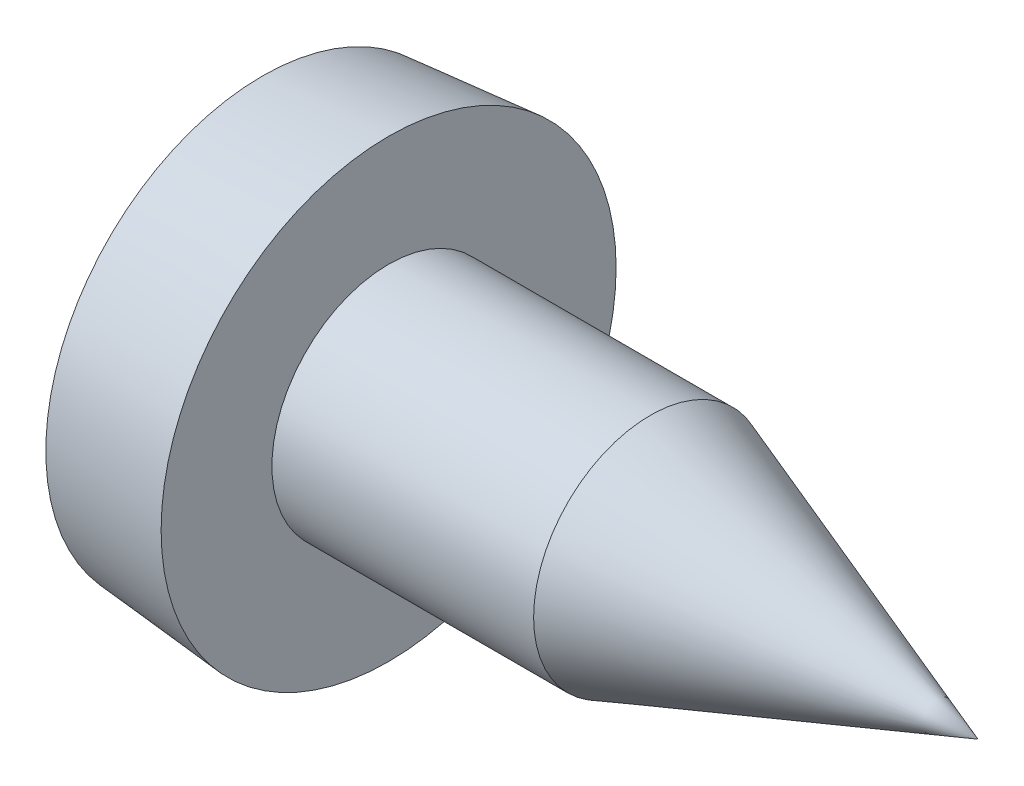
ISO-10303-21;
HEADER;
FILE_DESCRIPTION(('STEP AP214'),'2;1');
FILE_NAME('part.step','',(''),(''),'','','');
FILE_SCHEMA(('AUTOMOTIVE_DESIGN { 1 0 10303 214 1 1 1 1 }'));
ENDSEC;
DATA;
#1=APPLICATION_CONTEXT('core data for automotive mechanical design processes');
#2=APPLICATION_PROTOCOL_DEFINITION('international standard','automotive_design',2000,#1);
#3=PRODUCT_CONTEXT('',#1,'mechanical');
#4=PRODUCT('Part','Part','',(#3));
#5=PRODUCT_RELATED_PRODUCT_CATEGORY('part','',(#4));
#6=PRODUCT_DEFINITION_FORMATION('','',#4);
#7=PRODUCT_DEFINITION_CONTEXT('part definition',#1,'design');
#8=PRODUCT_DEFINITION('design','',#6,#7);
#9=PRODUCT_DEFINITION_SHAPE('','',#8);
#10=(LENGTH_UNIT() NAMED_UNIT(*) SI_UNIT(.MILLI.,.METRE.));
#11=(NAMED_UNIT(*) PLANE_ANGLE_UNIT() SI_UNIT($,.RADIAN.));
#12=(NAMED_UNIT(*) SI_UNIT($,.STERADIAN.) SOLID_ANGLE_UNIT());
#13=UNCERTAINTY_MEASURE_WITH_UNIT(LENGTH_MEASURE(1.E-05),#10,'distance_accuracy_value','');
#14=(GEOMETRIC_REPRESENTATION_CONTEXT(3) GLOBAL_UNCERTAINTY_ASSIGNED_CONTEXT((#13)) GLOBAL_UNIT_ASSIGNED_CONTEXT((#10,
#11,#12)) REPRESENTATION_CONTEXT('',''));
#15=CARTESIAN_POINT('',(0.,0.,0.));
#16=DIRECTION('',(0.,0.,1.));
#17=DIRECTION('',(1.,0.,0.));
#18=AXIS2_PLACEMENT_3D('',#15,#16,#17);
#19=CARTESIAN_POINT('',(-0.220536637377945,0.433234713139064,0.43323471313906));
#20=DIRECTION('',(1.,0.,0.));
#21=DIRECTION('',(0.,0.,-1.));
#22=AXIS2_PLACEMENT_3D('',#19,#20,#21);
#23=CONICAL_SURFACE('',#22,0.324449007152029,0.0872664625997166);
#24=CARTESIAN_POINT('',(-0.313800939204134,0.116951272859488,0.431286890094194));
#25=CARTESIAN_POINT('',(-0.309202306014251,0.116604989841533,0.422417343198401));
#26=CARTESIAN_POINT('',(-0.304644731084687,0.116632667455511,0.413518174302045));
#27=CARTESIAN_POINT('',(-0.295653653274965,0.117457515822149,0.395676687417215));
#28=CARTESIAN_POINT('',(-0.29122034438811,0.11825582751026,0.38673432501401));
#29=CARTESIAN_POINT('',(-0.278098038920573,0.121864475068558,0.35971631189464));
#30=CARTESIAN_POINT('',(-0.269686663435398,0.125896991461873,0.34163977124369));
#31=CARTESIAN_POINT('',(-0.256736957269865,0.135676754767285,0.311365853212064));
#32=CARTESIAN_POINT('',(-0.251797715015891,0.140532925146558,0.299048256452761));
#33=CARTESIAN_POINT('',(-0.243113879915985,0.152014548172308,0.274860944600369));
#34=CARTESIAN_POINT('',(-0.239364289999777,0.158632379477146,0.262989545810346));
#35=CARTESIAN_POINT('',(-0.234059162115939,0.172401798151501,0.241930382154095));
#36=CARTESIAN_POINT('',(-0.23223981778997,0.179273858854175,0.23262829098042));
#37=CARTESIAN_POINT('',(-0.230041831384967,0.194168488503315,0.21480852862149));
#38=CARTESIAN_POINT('',(-0.229661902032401,0.202190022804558,0.206290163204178));
#39=CARTESIAN_POINT('',(-0.230405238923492,0.219154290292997,0.190308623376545));
#40=CARTESIAN_POINT('',(-0.231528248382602,0.228096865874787,0.182845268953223));
#41=CARTESIAN_POINT('',(-0.235096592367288,0.246626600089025,0.169126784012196));
#42=CARTESIAN_POINT('',(-0.237543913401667,0.25621470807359,0.162873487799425));
#43=CARTESIAN_POINT('',(-0.244545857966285,0.27939661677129,0.149543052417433));
#44=CARTESIAN_POINT('',(-0.24954452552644,0.293166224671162,0.14300937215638));
#45=CARTESIAN_POINT('',(-0.260742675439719,0.321108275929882,0.13215276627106));
#46=CARTESIAN_POINT('',(-0.266946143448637,0.335281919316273,0.127837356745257));
#47=CARTESIAN_POINT('',(-0.279776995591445,0.363184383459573,0.121433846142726));
#48=CARTESIAN_POINT('',(-0.286376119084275,0.376907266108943,0.119260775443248));
#49=CARTESIAN_POINT('',(-0.299897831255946,0.404210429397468,0.116765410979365));
#50=CARTESIAN_POINT('',(-0.306816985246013,0.417790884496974,0.116426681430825));
#51=CARTESIAN_POINT('',(-0.313800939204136,0.431286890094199,0.116951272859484));
#52=B_SPLINE_CURVE_WITH_KNOTS('',3,(#24,#25,#26,#27,#28,#29,#30,#31,#32,#33,#34,#35,#36,#37,#38,
#39,#40,#41,#42,#43,#44,#45,#46,#47,#48,#49,#50,#51),.UNSPECIFIED.,.F.,.F.,(4,2,2,2,2,2,2,2,2,2,
2,2,2,4),(0.,0.0299710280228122,0.0599864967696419,0.12065536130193,0.162922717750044,
0.205010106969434,0.239980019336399,0.274918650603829,0.30985131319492,0.344836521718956,
0.392694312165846,0.440713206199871,0.48674012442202,0.532353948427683),.UNSPECIFIED.);
#53=CARTESIAN_POINT('',(-0.313800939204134,0.116951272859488,0.431286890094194));
#54=VERTEX_POINT('',#53);
#55=CARTESIAN_POINT('',(-0.313800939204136,0.431286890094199,0.116951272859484));
#56=VERTEX_POINT('',#55);
#57=EDGE_CURVE('E304',#54,#56,#52,.T.);
#58=ORIENTED_EDGE('',*,*,#57,.F.);
#59=DIRECTION('',(0.996194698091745,-0.0871540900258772,-0.000536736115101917));
#60=VECTOR('',#59,1.);
#61=CARTESIAN_POINT('',(-1.78399148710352,0.245573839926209,0.432079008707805));
#62=LINE('',#61,#60);
#63=CARTESIAN_POINT('',(-1.78399148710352,0.245573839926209,0.432079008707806));
#64=VERTEX_POINT('',#63);
#65=EDGE_CURVE('E171',#64,#54,#62,.T.);
#66=ORIENTED_EDGE('',*,*,#65,.F.);
#67=CARTESIAN_POINT('',(-1.78399148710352,0.24557383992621,0.432079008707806));
#68=CARTESIAN_POINT('',(-1.78470711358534,0.245692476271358,0.421492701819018));
#69=CARTESIAN_POINT('',(-1.78535994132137,0.246719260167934,0.410915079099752));
#70=CARTESIAN_POINT('',(-1.78652404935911,0.250523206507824,0.390078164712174));
#71=CARTESIAN_POINT('',(-1.78703542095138,0.25329923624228,0.379818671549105));
#72=CARTESIAN_POINT('',(-1.78790188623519,0.260538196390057,0.359898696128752));
#73=CARTESIAN_POINT('',(-1.78825688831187,0.265002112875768,0.35023856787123));
#74=CARTESIAN_POINT('',(-1.78880003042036,0.275487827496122,0.331802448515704));
#75=CARTESIAN_POINT('',(-1.78898821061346,0.281509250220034,0.323026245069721));
#76=CARTESIAN_POINT('',(-1.78919205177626,0.294922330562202,0.306629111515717));
#77=CARTESIAN_POINT('',(-1.78920817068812,0.302310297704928,0.299005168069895));
#78=CARTESIAN_POINT('',(-1.78906860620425,0.318256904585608,0.285101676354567));
#79=CARTESIAN_POINT('',(-1.78891292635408,0.326815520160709,0.278822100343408));
#80=CARTESIAN_POINT('',(-1.7884345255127,0.344851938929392,0.267788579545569));
#81=CARTESIAN_POINT('',(-1.78811191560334,0.354329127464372,0.263033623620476));
#82=CARTESIAN_POINT('',(-1.78730897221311,0.373936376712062,0.255178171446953));
#83=CARTESIAN_POINT('',(-1.7868287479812,0.384065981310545,0.252076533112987));
#84=CARTESIAN_POINT('',(-1.78594516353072,0.400572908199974,0.248498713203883));
#85=CARTESIAN_POINT('',(-1.78558735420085,0.406838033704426,0.247468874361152));
#86=CARTESIAN_POINT('',(-1.78482421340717,0.419426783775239,0.246044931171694));
#87=CARTESIAN_POINT('',(-1.78441896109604,0.425750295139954,0.245649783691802));
#88=CARTESIAN_POINT('',(-1.78399148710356,0.432079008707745,0.245573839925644));
#89=B_SPLINE_CURVE_WITH_KNOTS('',3,(#67,#68,#69,#70,#71,#72,#73,#74,#75,#76,#77,#78,#79,#80,#81,
#82,#83,#84,#85,#86,#87,#88),.UNSPECIFIED.,.F.,.F.,(4,2,2,2,2,2,2,2,2,2,4),(0.,
0.0317923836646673,0.0635642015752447,0.0953546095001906,0.127137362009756,0.158835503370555,
0.190532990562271,0.222209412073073,0.253863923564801,0.272912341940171,0.291929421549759),.UNSPECIFIED.);
#90=CARTESIAN_POINT('',(-1.78399148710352,0.43207900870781,0.245573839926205));
#91=VERTEX_POINT('',#90);
#92=EDGE_CURVE('E20',#64,#91,#89,.T.);
#93=ORIENTED_EDGE('',*,*,#92,.T.);
#94=DIRECTION('',(-0.996194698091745,0.00053673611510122,0.0871540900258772));
#95=VECTOR('',#94,1.);
#96=CARTESIAN_POINT('',(-0.313800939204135,0.431286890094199,0.116951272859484));
#97=LINE('',#96,#95);
#98=EDGE_CURVE('E168',#56,#91,#97,.T.);
#99=ORIENTED_EDGE('',*,*,#98,.F.);
#100=EDGE_LOOP('',(#58,#66,#93,#99));
#101=FACE_BOUND('',#100,.T.);
#102=ADVANCED_FACE('F16',(#101),#23,.T.);
#103=CARTESIAN_POINT('',(-0.482271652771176,0.,0.));
#104=DIRECTION('',(-1.,0.,0.));
#105=DIRECTION('',(0.,0.,1.));
#106=AXIS2_PLACEMENT_3D('',#103,#104,#105);
#107=CONICAL_SURFACE('',#106,0.763709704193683,0.462512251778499);
#108=CARTESIAN_POINT('',(-0.482271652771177,0.,0.));
#109=DIRECTION('',(-1.,0.,0.));
#110=DIRECTION('',(0.,1.,0.));
#111=AXIS2_PLACEMENT_3D('',#108,#109,#110);
#112=CIRCLE('',#111,0.763709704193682);
#113=CARTESIAN_POINT('',(-0.482271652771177,-0.129711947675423,0.752613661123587));
#114=VERTEX_POINT('',#113);
#115=CARTESIAN_POINT('',(-0.482271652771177,0.129711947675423,0.752613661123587));
#116=VERTEX_POINT('',#115);
#117=EDGE_CURVE('E313',#114,#116,#112,.T.);
#118=ORIENTED_EDGE('',*,*,#117,.F.);
#119=DIRECTION('',(0.894934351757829,0.075589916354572,-0.439748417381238));
#120=VECTOR('',#119,1.);
#121=CARTESIAN_POINT('',(-1.59113742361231,-0.223371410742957,1.29748264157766));
#122=LINE('',#121,#120);
#123=CARTESIAN_POINT('',(-1.59113742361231,-0.223371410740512,1.29748264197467));
#124=VERTEX_POINT('',#123);
#125=EDGE_CURVE('E590',#124,#114,#122,.T.);
#126=ORIENTED_EDGE('',*,*,#125,.F.);
#127=CARTESIAN_POINT('',(-1.59113742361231,0.,0.));
#128=DIRECTION('',(-1.,0.,0.));
#129=DIRECTION('',(0.,0.,-1.));
#130=AXIS2_PLACEMENT_3D('',#127,#128,#129);
#131=CIRCLE('',#130,1.31656978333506);
#132=CARTESIAN_POINT('',(-1.59113742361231,0.223371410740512,1.29748264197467));
#133=VERTEX_POINT('',#132);
#134=EDGE_CURVE('E503',#133,#124,#131,.F.);
#135=ORIENTED_EDGE('',*,*,#134,.F.);
#136=DIRECTION('',(-0.894934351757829,0.075589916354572,0.439748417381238));
#137=VECTOR('',#136,1.);
#138=CARTESIAN_POINT('',(-0.482271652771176,0.129711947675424,0.752613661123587));
#139=LINE('',#138,#137);
#140=EDGE_CURVE('E523',#116,#133,#139,.T.);
#141=ORIENTED_EDGE('',*,*,#140,.F.);
#142=EDGE_LOOP('',(#118,#126,#135,#141));
#143=FACE_BOUND('',#142,.T.);
#144=ADVANCED_FACE('F320',(#143),#107,.F.);
#145=CARTESIAN_POINT('',(-0.220536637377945,-0.433234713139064,0.43323471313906));
#146=DIRECTION('',(1.,0.,0.));
#147=DIRECTION('',(0.,0.,-1.));
#148=AXIS2_PLACEMENT_3D('',#145,#146,#147);
#149=CONICAL_SURFACE('',#148,0.324449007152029,0.0872664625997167);
#150=CARTESIAN_POINT('',(-0.313800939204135,-0.431286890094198,0.116951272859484));
#151=CARTESIAN_POINT('',(-0.309202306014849,-0.42241734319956,0.116604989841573));
#152=CARTESIAN_POINT('',(-0.304644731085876,-0.413518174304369,0.116632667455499));
#153=CARTESIAN_POINT('',(-0.295653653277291,-0.395676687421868,0.11745751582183));
#154=CARTESIAN_POINT('',(-0.291220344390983,-0.386734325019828,0.118255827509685));
#155=CARTESIAN_POINT('',(-0.278098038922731,-0.359716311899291,0.121864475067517));
#156=CARTESIAN_POINT('',(-0.269686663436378,-0.341639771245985,0.12589699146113));
#157=CARTESIAN_POINT('',(-0.256736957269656,-0.311365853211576,0.135676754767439));
#158=CARTESIAN_POINT('',(-0.251797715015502,-0.299048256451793,0.140532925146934));
#159=CARTESIAN_POINT('',(-0.243113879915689,-0.274860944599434,0.15201454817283));
#160=CARTESIAN_POINT('',(-0.239364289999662,-0.262989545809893,0.15863237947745));
#161=CARTESIAN_POINT('',(-0.234059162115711,-0.241930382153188,0.172401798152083));
#162=CARTESIAN_POINT('',(-0.232239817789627,-0.232628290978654,0.179273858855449));
#163=CARTESIAN_POINT('',(-0.230041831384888,-0.214808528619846,0.194168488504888));
#164=CARTESIAN_POINT('',(-0.229661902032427,-0.206290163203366,0.202190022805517));
#165=CARTESIAN_POINT('',(-0.230405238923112,-0.19030862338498,0.219154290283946));
#166=CARTESIAN_POINT('',(-0.231528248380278,-0.182845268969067,0.228096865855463));
#167=CARTESIAN_POINT('',(-0.235096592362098,-0.169126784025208,0.246626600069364));
#168=CARTESIAN_POINT('',(-0.237543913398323,-0.162873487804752,0.256214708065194));
#169=CARTESIAN_POINT('',(-0.244545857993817,-0.149543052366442,0.279396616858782));
#170=CARTESIAN_POINT('',(-0.249544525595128,-0.143009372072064,0.293166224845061));
#171=CARTESIAN_POINT('',(-0.260742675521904,-0.13215276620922,0.321108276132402));
#172=CARTESIAN_POINT('',(-0.266946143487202,-0.127837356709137,0.335281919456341));
#173=CARTESIAN_POINT('',(-0.279776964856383,-0.121433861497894,0.363184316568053));
#174=CARTESIAN_POINT('',(-0.286376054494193,-0.119260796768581,0.376907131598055));
#175=CARTESIAN_POINT('',(-0.299897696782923,-0.116765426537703,0.40421016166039));
#176=CARTESIAN_POINT('',(-0.306816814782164,-0.116426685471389,0.417790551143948));
#177=CARTESIAN_POINT('',(-0.313800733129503,-0.116951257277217,0.431286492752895));
#178=B_SPLINE_CURVE_WITH_KNOTS('',3,(#150,#151,#152,#153,#154,#155,#156,#157,#158,#159,#160,
#161,#162,#163,#164,#165,#166,#167,#168,#169,#170,#171,#172,#173,#174,#175,#176,#177),
.UNSPECIFIED.,.F.,.F.,(4,2,2,2,2,2,2,2,2,2,2,2,2,4),(0.,0.0299710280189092,0.0599864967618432,
0.120655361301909,0.162922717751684,0.205010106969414,0.239980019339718,0.274918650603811,
0.309851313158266,0.344836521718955,0.39269431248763,0.44071320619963,0.486739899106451,
0.532353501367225),.UNSPECIFIED.);
#179=CARTESIAN_POINT('',(-0.313800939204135,-0.431286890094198,0.116951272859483));
#180=VERTEX_POINT('',#179);
#181=CARTESIAN_POINT('',(-0.313800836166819,-0.116951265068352,0.431286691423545));
#182=VERTEX_POINT('',#181);
#183=EDGE_CURVE('E308',#180,#182,#178,.T.);
#184=ORIENTED_EDGE('',*,*,#183,.F.);
#185=DIRECTION('',(0.996194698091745,0.000536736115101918,-0.0871540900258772));
#186=VECTOR('',#185,1.);
#187=CARTESIAN_POINT('',(-1.78399148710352,-0.432079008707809,0.245573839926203));
#188=LINE('',#187,#186);
#189=CARTESIAN_POINT('',(-1.78399148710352,-0.432079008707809,0.245573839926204));
#190=VERTEX_POINT('',#189);
#191=EDGE_CURVE('E492',#190,#180,#188,.T.);
#192=ORIENTED_EDGE('',*,*,#191,.F.);
#193=CARTESIAN_POINT('',(-1.78399148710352,-0.432079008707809,0.245573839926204));
#194=CARTESIAN_POINT('',(-1.78470711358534,-0.421492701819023,0.245692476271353));
#195=CARTESIAN_POINT('',(-1.78535994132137,-0.410915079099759,0.246719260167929));
#196=CARTESIAN_POINT('',(-1.78652404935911,-0.39007816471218,0.25052320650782));
#197=CARTESIAN_POINT('',(-1.78703542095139,-0.379818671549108,0.253299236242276));
#198=CARTESIAN_POINT('',(-1.7879018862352,-0.359898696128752,0.260538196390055));
#199=CARTESIAN_POINT('',(-1.78825688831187,-0.350238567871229,0.265002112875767));
#200=CARTESIAN_POINT('',(-1.78880003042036,-0.331802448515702,0.275487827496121));
#201=CARTESIAN_POINT('',(-1.78898821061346,-0.32302624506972,0.281509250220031));
#202=CARTESIAN_POINT('',(-1.78919205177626,-0.306629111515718,0.294922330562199));
#203=CARTESIAN_POINT('',(-1.78920817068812,-0.299005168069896,0.302310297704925));
#204=CARTESIAN_POINT('',(-1.78906860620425,-0.285101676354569,0.318256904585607));
#205=CARTESIAN_POINT('',(-1.78891292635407,-0.278822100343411,0.326815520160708));
#206=CARTESIAN_POINT('',(-1.7884345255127,-0.267788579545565,0.344851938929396));
#207=CARTESIAN_POINT('',(-1.78811191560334,-0.263033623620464,0.354329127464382));
#208=CARTESIAN_POINT('',(-1.78730897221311,-0.25517817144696,0.373936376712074));
#209=CARTESIAN_POINT('',(-1.78682874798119,-0.25207653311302,0.384065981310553));
#210=CARTESIAN_POINT('',(-1.78594516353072,-0.248498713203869,0.400572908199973));
#211=CARTESIAN_POINT('',(-1.78558735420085,-0.247468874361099,0.406838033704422));
#212=CARTESIAN_POINT('',(-1.78482421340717,-0.246044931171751,0.41942678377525));
#213=CARTESIAN_POINT('',(-1.78441896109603,-0.245649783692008,0.425750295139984));
#214=CARTESIAN_POINT('',(-1.78399148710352,-0.245573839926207,0.432079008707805));
#215=B_SPLINE_CURVE_WITH_KNOTS('',3,(#193,#194,#195,#196,#197,#198,#199,#200,#201,#202,#203,
#204,#205,#206,#207,#208,#209,#210,#211,#212,#213,#214),.UNSPECIFIED.,.F.,.F.,(4,2,2,2,2,2,2,2,
2,2,4),(0.,0.0317923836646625,0.0635642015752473,0.0953546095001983,0.127137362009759,
0.158835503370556,0.190532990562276,0.222209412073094,0.253863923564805,0.272912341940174,
0.29192942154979),.UNSPECIFIED.);
#216=CARTESIAN_POINT('',(-1.78399148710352,-0.245573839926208,0.432079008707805));
#217=VERTEX_POINT('',#216);
#218=EDGE_CURVE('E173',#190,#217,#215,.T.);
#219=ORIENTED_EDGE('',*,*,#218,.T.);
#220=DIRECTION('',(-0.996194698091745,-0.0871540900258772,0.000536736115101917));
#221=VECTOR('',#220,1.);
#222=CARTESIAN_POINT('',(-0.313800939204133,-0.116951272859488,0.431286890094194));
#223=LINE('',#222,#221);
#224=EDGE_CURVE('E495',#182,#217,#223,.T.);
#225=ORIENTED_EDGE('',*,*,#224,.F.);
#226=EDGE_LOOP('',(#184,#192,#219,#225));
#227=FACE_BOUND('',#226,.T.);
#228=ADVANCED_FACE('F315',(#227),#149,.T.);
#229=CARTESIAN_POINT('',(-0.482271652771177,0.,0.));
#230=DIRECTION('',(-1.,0.,0.));
#231=DIRECTION('',(0.,0.,1.));
#232=AXIS2_PLACEMENT_3D('',#229,#230,#231);
#233=CONICAL_SURFACE('',#232,0.763709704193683,0.462512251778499);
#234=CARTESIAN_POINT('',(-0.482271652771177,0.,0.));
#235=DIRECTION('',(-1.,0.,0.));
#236=DIRECTION('',(0.,1.,0.));
#237=AXIS2_PLACEMENT_3D('',#234,#235,#236);
#238=CIRCLE('',#237,0.763709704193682);
#239=CARTESIAN_POINT('',(-0.482271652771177,-0.752613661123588,-0.129711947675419));
#240=VERTEX_POINT('',#239);
#241=CARTESIAN_POINT('',(-0.482271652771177,-0.752613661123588,0.129711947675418));
#242=VERTEX_POINT('',#241);
#243=EDGE_CURVE('E314',#240,#242,#238,.T.);
#244=ORIENTED_EDGE('',*,*,#243,.F.);
#245=DIRECTION('',(0.894934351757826,0.439748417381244,0.0755899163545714));
#246=VECTOR('',#245,1.);
#247=CARTESIAN_POINT('',(-1.59113742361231,-1.29748264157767,-0.223371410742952));
#248=LINE('',#247,#246);
#249=CARTESIAN_POINT('',(-1.59113742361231,-1.29748264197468,-0.223371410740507));
#250=VERTEX_POINT('',#249);
#251=EDGE_CURVE('E599',#250,#240,#248,.T.);
#252=ORIENTED_EDGE('',*,*,#251,.F.);
#253=CARTESIAN_POINT('',(-1.59113742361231,0.,0.));
#254=DIRECTION('',(-1.,0.,0.));
#255=DIRECTION('',(0.,0.,-1.));
#256=AXIS2_PLACEMENT_3D('',#253,#254,#255);
#257=CIRCLE('',#256,1.31656978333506);
#258=CARTESIAN_POINT('',(-1.59113742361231,-1.29748264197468,0.223371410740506));
#259=VERTEX_POINT('',#258);
#260=EDGE_CURVE('E464',#259,#250,#257,.F.);
#261=ORIENTED_EDGE('',*,*,#260,.F.);
#262=DIRECTION('',(-0.894934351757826,-0.439748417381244,0.0755899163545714));
#263=VECTOR('',#262,1.);
#264=CARTESIAN_POINT('',(-0.482271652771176,-0.752613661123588,0.129711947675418));
#265=LINE('',#264,#263);
#266=EDGE_CURVE('E487',#242,#259,#265,.T.);
#267=ORIENTED_EDGE('',*,*,#266,.F.);
#268=EDGE_LOOP('',(#244,#252,#261,#267));
#269=FACE_BOUND('',#268,.T.);
#270=ADVANCED_FACE('F319',(#269),#233,.F.);
#271=CARTESIAN_POINT('',(-0.220536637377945,-0.433234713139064,-0.43323471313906));
#272=DIRECTION('',(1.,0.,0.));
#273=DIRECTION('',(0.,0.,-1.));
#274=AXIS2_PLACEMENT_3D('',#271,#272,#273);
#275=CONICAL_SURFACE('',#274,0.324449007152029,0.0872664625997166);
#276=CARTESIAN_POINT('',(-0.313800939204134,-0.116951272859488,-0.431286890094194));
#277=CARTESIAN_POINT('',(-0.309202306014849,-0.116604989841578,-0.422417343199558));
#278=CARTESIAN_POINT('',(-0.304644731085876,-0.116632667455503,-0.413518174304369));
#279=CARTESIAN_POINT('',(-0.295653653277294,-0.117457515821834,-0.395676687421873));
#280=CARTESIAN_POINT('',(-0.291220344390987,-0.118255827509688,-0.386734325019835));
#281=CARTESIAN_POINT('',(-0.278098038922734,-0.121864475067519,-0.359716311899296));
#282=CARTESIAN_POINT('',(-0.269686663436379,-0.125896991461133,-0.341639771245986));
#283=CARTESIAN_POINT('',(-0.256736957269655,-0.135676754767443,-0.311365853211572));
#284=CARTESIAN_POINT('',(-0.251797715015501,-0.140532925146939,-0.299048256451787));
#285=CARTESIAN_POINT('',(-0.243113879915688,-0.152014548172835,-0.274860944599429));
#286=CARTESIAN_POINT('',(-0.239364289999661,-0.158632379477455,-0.262989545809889));
#287=CARTESIAN_POINT('',(-0.23405916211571,-0.172401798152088,-0.241930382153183));
#288=CARTESIAN_POINT('',(-0.232239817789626,-0.179273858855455,-0.232628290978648));
#289=CARTESIAN_POINT('',(-0.230041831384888,-0.194168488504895,-0.214808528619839));
#290=CARTESIAN_POINT('',(-0.229661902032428,-0.202190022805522,-0.206290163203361));
#291=CARTESIAN_POINT('',(-0.230405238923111,-0.219154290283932,-0.190308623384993));
#292=CARTESIAN_POINT('',(-0.231528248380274,-0.228096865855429,-0.182845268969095));
#293=CARTESIAN_POINT('',(-0.235096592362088,-0.246626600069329,-0.169126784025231));
#294=CARTESIAN_POINT('',(-0.237543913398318,-0.256214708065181,-0.162873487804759));
#295=CARTESIAN_POINT('',(-0.244545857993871,-0.279396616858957,-0.149543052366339));
#296=CARTESIAN_POINT('',(-0.249544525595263,-0.293166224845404,-0.143009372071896));
#297=CARTESIAN_POINT('',(-0.260742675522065,-0.321108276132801,-0.132152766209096));
#298=CARTESIAN_POINT('',(-0.266946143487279,-0.335281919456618,-0.127837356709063));
#299=CARTESIAN_POINT('',(-0.279776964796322,-0.363184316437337,-0.121433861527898));
#300=CARTESIAN_POINT('',(-0.286376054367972,-0.376907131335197,-0.119260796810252));
#301=CARTESIAN_POINT('',(-0.299897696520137,-0.404210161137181,-0.116765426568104));
#302=CARTESIAN_POINT('',(-0.306816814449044,-0.417790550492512,-0.116426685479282));
#303=CARTESIAN_POINT('',(-0.313800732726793,-0.431286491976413,-0.116951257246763));
#304=B_SPLINE_CURVE_WITH_KNOTS('',3,(#276,#277,#278,#279,#280,#281,#282,#283,#284,#285,#286,
#287,#288,#289,#290,#291,#292,#293,#294,#295,#296,#297,#298,#299,#300,#301,#302,#303),
.UNSPECIFIED.,.F.,.F.,(4,2,2,2,2,2,2,2,2,2,2,2,2,4),(0.,0.0299710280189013,0.0599864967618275,
0.120655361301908,0.162922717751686,0.205010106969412,0.239980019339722,0.274918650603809,
0.309851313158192,0.344836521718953,0.392694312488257,0.440713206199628,0.486739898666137,
0.532353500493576),.UNSPECIFIED.);
#305=CARTESIAN_POINT('',(-0.313800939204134,-0.116951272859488,-0.431286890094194));
#306=VERTEX_POINT('',#305);
#307=CARTESIAN_POINT('',(-0.313800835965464,-0.431286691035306,-0.116951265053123));
#308=VERTEX_POINT('',#307);
#309=EDGE_CURVE('E246',#306,#308,#304,.T.);
#310=ORIENTED_EDGE('',*,*,#309,.F.);
#311=DIRECTION('',(0.996194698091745,0.0871540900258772,0.000536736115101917));
#312=VECTOR('',#311,1.);
#313=CARTESIAN_POINT('',(-1.78399148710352,-0.245573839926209,-0.432079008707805));
#314=LINE('',#313,#312);
#315=CARTESIAN_POINT('',(-1.78399148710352,-0.245573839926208,-0.432079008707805));
#316=VERTEX_POINT('',#315);
#317=EDGE_CURVE('E453',#316,#306,#314,.T.);
#318=ORIENTED_EDGE('',*,*,#317,.F.);
#319=CARTESIAN_POINT('',(-1.78399148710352,-0.245573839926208,-0.432079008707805));
#320=CARTESIAN_POINT('',(-1.78470711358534,-0.245692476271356,-0.421492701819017));
#321=CARTESIAN_POINT('',(-1.78535994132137,-0.246719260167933,-0.410915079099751));
#322=CARTESIAN_POINT('',(-1.78652404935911,-0.250523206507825,-0.390078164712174));
#323=CARTESIAN_POINT('',(-1.78703542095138,-0.253299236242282,-0.379818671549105));
#324=CARTESIAN_POINT('',(-1.78790188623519,-0.260538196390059,-0.359898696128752));
#325=CARTESIAN_POINT('',(-1.78825688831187,-0.265002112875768,-0.350238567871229));
#326=CARTESIAN_POINT('',(-1.78880003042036,-0.275487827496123,-0.331802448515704));
#327=CARTESIAN_POINT('',(-1.78898821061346,-0.281509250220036,-0.323026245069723));
#328=CARTESIAN_POINT('',(-1.78919205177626,-0.294922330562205,-0.306629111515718));
#329=CARTESIAN_POINT('',(-1.78920817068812,-0.302310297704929,-0.299005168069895));
#330=CARTESIAN_POINT('',(-1.78906860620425,-0.318256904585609,-0.285101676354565));
#331=CARTESIAN_POINT('',(-1.78891292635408,-0.32681552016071,-0.278822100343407));
#332=CARTESIAN_POINT('',(-1.7884345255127,-0.344851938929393,-0.267788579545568));
#333=CARTESIAN_POINT('',(-1.78811191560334,-0.354329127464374,-0.263033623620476));
#334=CARTESIAN_POINT('',(-1.78730897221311,-0.373936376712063,-0.255178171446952));
#335=CARTESIAN_POINT('',(-1.7868287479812,-0.384065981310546,-0.252076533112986));
#336=CARTESIAN_POINT('',(-1.78594516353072,-0.400572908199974,-0.248498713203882));
#337=CARTESIAN_POINT('',(-1.78558735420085,-0.406838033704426,-0.247468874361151));
#338=CARTESIAN_POINT('',(-1.78482421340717,-0.419426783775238,-0.246044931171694));
#339=CARTESIAN_POINT('',(-1.78441896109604,-0.425750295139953,-0.245649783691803));
#340=CARTESIAN_POINT('',(-1.78399148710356,-0.432079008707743,-0.245573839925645));
#341=B_SPLINE_CURVE_WITH_KNOTS('',3,(#319,#320,#321,#322,#323,#324,#325,#326,#327,#328,#329,
#330,#331,#332,#333,#334,#335,#336,#337,#338,#339,#340),.UNSPECIFIED.,.F.,.F.,(4,2,2,2,2,2,2,2,
2,2,4),(0.,0.0317923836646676,0.0635642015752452,0.0953546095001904,0.127137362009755,
0.158835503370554,0.190532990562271,0.222209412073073,0.253863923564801,0.27291234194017,
0.291929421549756),.UNSPECIFIED.);
#342=CARTESIAN_POINT('',(-1.78399148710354,-0.432079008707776,-0.245573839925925));
#343=VERTEX_POINT('',#342);
#344=EDGE_CURVE('E327',#316,#343,#341,.T.);
#345=ORIENTED_EDGE('',*,*,#344,.T.);
#346=DIRECTION('',(-0.996194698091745,-0.00053673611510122,-0.0871540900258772));
#347=VECTOR('',#346,1.);
#348=CARTESIAN_POINT('',(-0.313800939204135,-0.431286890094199,-0.116951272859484));
#349=LINE('',#348,#347);
#350=EDGE_CURVE('E456',#308,#343,#349,.T.);
#351=ORIENTED_EDGE('',*,*,#350,.F.);
#352=EDGE_LOOP('',(#310,#318,#345,#351));
#353=FACE_BOUND('',#352,.T.);
#354=ADVANCED_FACE('F336',(#353),#275,.T.);
#355=CARTESIAN_POINT('',(-0.482271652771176,0.,0.));
#356=DIRECTION('',(-1.,0.,0.));
#357=DIRECTION('',(0.,0.,1.));
#358=AXIS2_PLACEMENT_3D('',#355,#356,#357);
#359=CONICAL_SURFACE('',#358,0.763709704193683,0.462512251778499);
#360=CARTESIAN_POINT('',(-0.482271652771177,0.,0.));
#361=DIRECTION('',(-1.,0.,0.));
#362=DIRECTION('',(0.,1.,0.));
#363=AXIS2_PLACEMENT_3D('',#360,#361,#362);
#364=CIRCLE('',#363,0.763709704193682);
#365=CARTESIAN_POINT('',(-0.482271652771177,0.129711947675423,-0.752613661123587));
#366=VERTEX_POINT('',#365);
#367=CARTESIAN_POINT('',(-0.482271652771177,-0.129711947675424,-0.752613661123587));
#368=VERTEX_POINT('',#367);
#369=EDGE_CURVE('E532',#366,#368,#364,.T.);
#370=ORIENTED_EDGE('',*,*,#369,.F.);
#371=DIRECTION('',(0.894934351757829,-0.075589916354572,0.439748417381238));
#372=VECTOR('',#371,1.);
#373=CARTESIAN_POINT('',(-1.59113742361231,0.223371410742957,-1.29748264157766));
#374=LINE('',#373,#372);
#375=CARTESIAN_POINT('',(-1.59113742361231,0.223371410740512,-1.29748264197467));
#376=VERTEX_POINT('',#375);
#377=EDGE_CURVE('E551',#376,#366,#374,.T.);
#378=ORIENTED_EDGE('',*,*,#377,.F.);
#379=CARTESIAN_POINT('',(-1.59113742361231,0.,0.));
#380=DIRECTION('',(-1.,0.,0.));
#381=DIRECTION('',(0.,0.,-1.));
#382=AXIS2_PLACEMENT_3D('',#379,#380,#381);
#383=CIRCLE('',#382,1.31656978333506);
#384=CARTESIAN_POINT('',(-1.59113742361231,-0.223371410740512,-1.29748264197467));
#385=VERTEX_POINT('',#384);
#386=EDGE_CURVE('E428',#385,#376,#383,.F.);
#387=ORIENTED_EDGE('',*,*,#386,.F.);
#388=DIRECTION('',(-0.894934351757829,-0.075589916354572,-0.439748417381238));
#389=VECTOR('',#388,1.);
#390=CARTESIAN_POINT('',(-0.482271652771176,-0.129711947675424,-0.752613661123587));
#391=LINE('',#390,#389);
#392=EDGE_CURVE('E448',#368,#385,#391,.T.);
#393=ORIENTED_EDGE('',*,*,#392,.F.);
#394=EDGE_LOOP('',(#370,#378,#387,#393));
#395=FACE_BOUND('',#394,.T.);
#396=ADVANCED_FACE('F339',(#395),#359,.F.);
#397=CARTESIAN_POINT('',(-0.220536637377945,0.433234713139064,-0.43323471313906));
#398=DIRECTION('',(1.,0.,0.));
#399=DIRECTION('',(0.,0.,-1.));
#400=AXIS2_PLACEMENT_3D('',#397,#398,#399);
#401=CONICAL_SURFACE('',#400,0.324449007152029,0.0872664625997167);
#402=CARTESIAN_POINT('',(-0.313800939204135,0.431286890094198,-0.116951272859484));
#403=CARTESIAN_POINT('',(-0.30920230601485,0.422417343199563,-0.116604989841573));
#404=CARTESIAN_POINT('',(-0.304644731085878,0.413518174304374,-0.116632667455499));
#405=CARTESIAN_POINT('',(-0.295653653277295,0.395676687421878,-0.117457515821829));
#406=CARTESIAN_POINT('',(-0.291220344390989,0.386734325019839,-0.118255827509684));
#407=CARTESIAN_POINT('',(-0.278098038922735,0.3597163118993,-0.121864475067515));
#408=CARTESIAN_POINT('',(-0.26968666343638,0.34163977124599,-0.125896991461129));
#409=CARTESIAN_POINT('',(-0.256736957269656,0.311365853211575,-0.135676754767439));
#410=CARTESIAN_POINT('',(-0.251797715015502,0.299048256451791,-0.140532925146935));
#411=CARTESIAN_POINT('',(-0.243113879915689,0.274860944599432,-0.152014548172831));
#412=CARTESIAN_POINT('',(-0.239364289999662,0.262989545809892,-0.158632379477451));
#413=CARTESIAN_POINT('',(-0.23405916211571,0.241930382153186,-0.172401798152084));
#414=CARTESIAN_POINT('',(-0.232239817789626,0.232628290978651,-0.179273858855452));
#415=CARTESIAN_POINT('',(-0.230041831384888,0.214808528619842,-0.194168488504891));
#416=CARTESIAN_POINT('',(-0.229661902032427,0.206290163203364,-0.202190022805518));
#417=CARTESIAN_POINT('',(-0.230405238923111,0.190308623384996,-0.219154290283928));
#418=CARTESIAN_POINT('',(-0.231528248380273,0.182845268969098,-0.228096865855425));
#419=CARTESIAN_POINT('',(-0.235096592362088,0.169126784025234,-0.246626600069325));
#420=CARTESIAN_POINT('',(-0.237543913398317,0.162873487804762,-0.256214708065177));
#421=CARTESIAN_POINT('',(-0.24454585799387,0.149543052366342,-0.279396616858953));
#422=CARTESIAN_POINT('',(-0.249544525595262,0.143009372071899,-0.2931662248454));
#423=CARTESIAN_POINT('',(-0.260742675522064,0.132152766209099,-0.321108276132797));
#424=CARTESIAN_POINT('',(-0.266946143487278,0.127837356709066,-0.335281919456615));
#425=CARTESIAN_POINT('',(-0.279776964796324,0.121433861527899,-0.363184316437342));
#426=CARTESIAN_POINT('',(-0.286376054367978,0.119260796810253,-0.376907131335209));
#427=CARTESIAN_POINT('',(-0.299897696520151,0.116765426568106,-0.404210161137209));
#428=CARTESIAN_POINT('',(-0.306816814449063,0.116426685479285,-0.417790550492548));
#429=CARTESIAN_POINT('',(-0.313800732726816,0.116951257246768,-0.431286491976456));
#430=B_SPLINE_CURVE_WITH_KNOTS('',3,(#402,#403,#404,#405,#406,#407,#408,#409,#410,#411,#412,
#413,#414,#415,#416,#417,#418,#419,#420,#421,#422,#423,#424,#425,#426,#427,#428,#429),
.UNSPECIFIED.,.F.,.F.,(4,2,2,2,2,2,2,2,2,2,2,2,2,4),(0.,0.0299710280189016,0.059986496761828,
0.120655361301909,0.162922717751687,0.205010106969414,0.239980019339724,0.274918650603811,
0.309851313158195,0.344836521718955,0.392694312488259,0.44071320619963,0.486739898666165,
0.532353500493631),.UNSPECIFIED.);
#431=CARTESIAN_POINT('',(-0.313800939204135,0.431286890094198,-0.116951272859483));
#432=VERTEX_POINT('',#431);
#433=CARTESIAN_POINT('',(-0.313800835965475,0.116951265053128,-0.431286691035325));
#434=VERTEX_POINT('',#433);
#435=EDGE_CURVE('E534',#432,#434,#430,.T.);
#436=ORIENTED_EDGE('',*,*,#435,.F.);
#437=DIRECTION('',(0.996194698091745,-0.000536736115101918,0.0871540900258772));
#438=VECTOR('',#437,1.);
#439=CARTESIAN_POINT('',(-1.78399148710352,0.432079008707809,-0.245573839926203));
#440=LINE('',#439,#438);
#441=CARTESIAN_POINT('',(-1.78399148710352,0.43207900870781,-0.245573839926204));
#442=VERTEX_POINT('',#441);
#443=EDGE_CURVE('E415',#442,#432,#440,.T.);
#444=ORIENTED_EDGE('',*,*,#443,.F.);
#445=CARTESIAN_POINT('',(-1.78399148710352,0.432079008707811,-0.245573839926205));
#446=CARTESIAN_POINT('',(-1.78470711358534,0.421492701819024,-0.245692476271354));
#447=CARTESIAN_POINT('',(-1.78535994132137,0.41091507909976,-0.246719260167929));
#448=CARTESIAN_POINT('',(-1.78652404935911,0.390078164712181,-0.250523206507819));
#449=CARTESIAN_POINT('',(-1.78703542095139,0.37981867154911,-0.253299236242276));
#450=CARTESIAN_POINT('',(-1.7879018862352,0.359898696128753,-0.260538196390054));
#451=CARTESIAN_POINT('',(-1.78825688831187,0.35023856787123,-0.265002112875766));
#452=CARTESIAN_POINT('',(-1.78880003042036,0.331802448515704,-0.275487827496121));
#453=CARTESIAN_POINT('',(-1.78898821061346,0.323026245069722,-0.281509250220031));
#454=CARTESIAN_POINT('',(-1.78919205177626,0.306629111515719,-0.294922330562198));
#455=CARTESIAN_POINT('',(-1.78920817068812,0.299005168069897,-0.302310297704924));
#456=CARTESIAN_POINT('',(-1.78906860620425,0.28510167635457,-0.318256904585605));
#457=CARTESIAN_POINT('',(-1.78891292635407,0.278822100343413,-0.326815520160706));
#458=CARTESIAN_POINT('',(-1.7884345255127,0.267788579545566,-0.344851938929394));
#459=CARTESIAN_POINT('',(-1.78811191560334,0.263033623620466,-0.354329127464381));
#460=CARTESIAN_POINT('',(-1.78730897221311,0.255178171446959,-0.373936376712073));
#461=CARTESIAN_POINT('',(-1.78682874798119,0.252076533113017,-0.384065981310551));
#462=CARTESIAN_POINT('',(-1.78594516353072,0.248498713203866,-0.400572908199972));
#463=CARTESIAN_POINT('',(-1.78558735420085,0.247468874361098,-0.406838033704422));
#464=CARTESIAN_POINT('',(-1.78482421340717,0.246044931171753,-0.41942678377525));
#465=CARTESIAN_POINT('',(-1.78441896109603,0.245649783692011,-0.425750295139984));
#466=CARTESIAN_POINT('',(-1.78399148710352,0.245573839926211,-0.432079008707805));
#467=B_SPLINE_CURVE_WITH_KNOTS('',3,(#445,#446,#447,#448,#449,#450,#451,#452,#453,#454,#455,
#456,#457,#458,#459,#460,#461,#462,#463,#464,#465,#466),.UNSPECIFIED.,.F.,.F.,(4,2,2,2,2,2,2,2,
2,2,4),(0.,0.0317923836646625,0.0635642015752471,0.0953546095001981,0.127137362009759,
0.158835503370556,0.190532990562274,0.222209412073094,0.253863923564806,0.272912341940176,
0.291929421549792),.UNSPECIFIED.);
#468=CARTESIAN_POINT('',(-1.78399148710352,0.245573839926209,-0.432079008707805));
#469=VERTEX_POINT('',#468);
#470=EDGE_CURVE('E332',#442,#469,#467,.T.);
#471=ORIENTED_EDGE('',*,*,#470,.T.);
#472=DIRECTION('',(-0.996194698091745,0.0871540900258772,-0.000536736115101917));
#473=VECTOR('',#472,1.);
#474=CARTESIAN_POINT('',(-0.313800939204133,0.116951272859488,-0.431286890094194));
#475=LINE('',#474,#473);
#476=EDGE_CURVE('E418',#434,#469,#475,.T.);
#477=ORIENTED_EDGE('',*,*,#476,.F.);
#478=EDGE_LOOP('',(#436,#444,#471,#477));
#479=FACE_BOUND('',#478,.T.);
#480=ADVANCED_FACE('F239',(#479),#401,.T.);
#481=CARTESIAN_POINT('',(-0.0761999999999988,0.,0.));
#482=DIRECTION('',(-1.,0.,0.));
#483=DIRECTION('',(0.,0.,1.));
#484=AXIS2_PLACEMENT_3D('',#481,#482,#483);
#485=CONICAL_SURFACE('',#484,0.,1.08210413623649);
#486=CARTESIAN_POINT('',(-0.0761999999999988,0.,0.));
#487=VERTEX_POINT('',#486);
#488=VERTEX_LOOP('',#487);
#489=FACE_BOUND('',#488,.T.);
#490=CARTESIAN_POINT('',(-0.313800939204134,0.116951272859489,0.431286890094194));
#491=CARTESIAN_POINT('',(-0.327724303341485,0.118004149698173,0.458125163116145));
#492=CARTESIAN_POINT('',(-0.341692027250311,0.119061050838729,0.484940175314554));
#493=CARTESIAN_POINT('',(-0.36969130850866,0.121180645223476,0.538536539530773));
#494=CARTESIAN_POINT('',(-0.383722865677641,0.122243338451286,0.565317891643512));
#495=CARTESIAN_POINT('',(-0.411824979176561,0.124372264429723,0.618859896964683));
#496=CARTESIAN_POINT('',(-0.425895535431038,0.125438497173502,0.64562055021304));
#497=CARTESIAN_POINT('',(-0.454065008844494,0.127573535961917,0.699126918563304));
#498=CARTESIAN_POINT('',(-0.468163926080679,0.12864234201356,0.725872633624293));
#499=CARTESIAN_POINT('',(-0.482271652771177,0.129711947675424,0.752613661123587));
#500=B_SPLINE_CURVE_WITH_KNOTS('',3,(#490,#491,#492,#493,#494,#495,#496,#497,#498,#499),
.UNSPECIFIED.,.F.,.F.,(4,2,2,2,4),(0.,0.0907597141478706,0.181519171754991,0.272278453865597,
0.363037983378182),.UNSPECIFIED.);
#501=EDGE_CURVE('E229',#54,#116,#500,.T.);
#502=ORIENTED_EDGE('',*,*,#501,.F.);
#503=ORIENTED_EDGE('',*,*,#57,.T.);
#504=CARTESIAN_POINT('',(-0.482271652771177,0.752613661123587,0.129711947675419));
#505=CARTESIAN_POINT('',(-0.468163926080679,0.725872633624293,0.128642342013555));
#506=CARTESIAN_POINT('',(-0.454065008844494,0.699126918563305,0.127573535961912));
#507=CARTESIAN_POINT('',(-0.425895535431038,0.645620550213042,0.125438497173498));
#508=CARTESIAN_POINT('',(-0.411824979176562,0.618859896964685,0.124372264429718));
#509=CARTESIAN_POINT('',(-0.383722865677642,0.565317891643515,0.122243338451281));
#510=CARTESIAN_POINT('',(-0.369691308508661,0.538536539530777,0.121180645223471));
#511=CARTESIAN_POINT('',(-0.341692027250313,0.484940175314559,0.119061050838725));
#512=CARTESIAN_POINT('',(-0.327724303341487,0.458125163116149,0.118004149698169));
#513=CARTESIAN_POINT('',(-0.313800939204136,0.431286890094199,0.116951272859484));
#514=B_SPLINE_CURVE_WITH_KNOTS('',3,(#504,#505,#506,#507,#508,#509,#510,#511,#512,#513),
.UNSPECIFIED.,.F.,.F.,(4,2,2,2,4),(0.,0.0907595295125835,0.181518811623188,0.272278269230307,
0.363037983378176),.UNSPECIFIED.);
#515=CARTESIAN_POINT('',(-0.482271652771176,0.752613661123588,0.129711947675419));
#516=VERTEX_POINT('',#515);
#517=EDGE_CURVE('E181',#516,#56,#514,.T.);
#518=ORIENTED_EDGE('',*,*,#517,.F.);
#519=CARTESIAN_POINT('',(-0.482271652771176,0.,0.));
#520=DIRECTION('',(-1.,0.,0.));
#521=DIRECTION('',(0.,1.,0.));
#522=AXIS2_PLACEMENT_3D('',#519,#520,#521);
#523=CIRCLE('',#522,0.763709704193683);
#524=CARTESIAN_POINT('',(-0.482271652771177,0.752613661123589,-0.129711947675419));
#525=VERTEX_POINT('',#524);
#526=EDGE_CURVE('E530',#525,#516,#523,.F.);
#527=ORIENTED_EDGE('',*,*,#526,.F.);
#528=CARTESIAN_POINT('',(-0.313800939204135,0.431286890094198,-0.116951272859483));
#529=CARTESIAN_POINT('',(-0.327724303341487,0.458125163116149,-0.118004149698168));
#530=CARTESIAN_POINT('',(-0.341692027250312,0.484940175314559,-0.119061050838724));
#531=CARTESIAN_POINT('',(-0.369691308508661,0.538536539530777,-0.12118064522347));
#532=CARTESIAN_POINT('',(-0.383722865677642,0.565317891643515,-0.12224333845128));
#533=CARTESIAN_POINT('',(-0.411824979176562,0.618859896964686,-0.124372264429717));
#534=CARTESIAN_POINT('',(-0.425895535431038,0.645620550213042,-0.125438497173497));
#535=CARTESIAN_POINT('',(-0.454065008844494,0.699126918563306,-0.127573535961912));
#536=CARTESIAN_POINT('',(-0.468163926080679,0.725872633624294,-0.128642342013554));
#537=CARTESIAN_POINT('',(-0.482271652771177,0.752613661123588,-0.129711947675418));
#538=B_SPLINE_CURVE_WITH_KNOTS('',3,(#528,#529,#530,#531,#532,#533,#534,#535,#536,#537),
.UNSPECIFIED.,.F.,.F.,(4,2,2,2,4),(0.,0.0907597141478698,0.181519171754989,0.272278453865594,
0.363037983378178),.UNSPECIFIED.);
#539=EDGE_CURVE('E256',#432,#525,#538,.T.);
#540=ORIENTED_EDGE('',*,*,#539,.F.);
#541=ORIENTED_EDGE('',*,*,#435,.T.);
#542=CARTESIAN_POINT('',(-0.482271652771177,0.129711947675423,-0.752613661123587));
#543=CARTESIAN_POINT('',(-0.468163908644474,0.128642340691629,-0.72587260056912));
#544=CARTESIAN_POINT('',(-0.4540649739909,0.127573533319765,-0.699126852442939));
#545=CARTESIAN_POINT('',(-0.425895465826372,0.125438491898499,-0.645620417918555));
#546=CARTESIAN_POINT('',(-0.411824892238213,0.124372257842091,-0.618859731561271));
#547=CARTESIAN_POINT('',(-0.383722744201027,0.122243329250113,-0.565317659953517));
#548=CARTESIAN_POINT('',(-0.369691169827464,0.121180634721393,-0.538536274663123));
#549=CARTESIAN_POINT('',(-0.341691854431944,0.119061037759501,-0.484939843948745));
#550=CARTESIAN_POINT('',(-0.327724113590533,0.118004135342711,-0.458124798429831));
#551=CARTESIAN_POINT('',(-0.31380073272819,0.116951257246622,-0.431286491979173));
#552=B_SPLINE_CURVE_WITH_KNOTS('',3,(#542,#543,#544,#545,#546,#547,#548,#549,#550,#551),
.UNSPECIFIED.,.F.,.F.,(4,2,2,2,4),(0.,0.0907596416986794,0.181519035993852,0.272278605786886,
0.3630384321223),.UNSPECIFIED.);
#553=EDGE_CURVE('E264',#366,#434,#552,.T.);
#554=ORIENTED_EDGE('',*,*,#553,.F.);
#555=ORIENTED_EDGE('',*,*,#369,.T.);
#556=CARTESIAN_POINT('',(-0.313800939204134,-0.116951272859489,-0.431286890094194));
#557=CARTESIAN_POINT('',(-0.327724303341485,-0.118004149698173,-0.458125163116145));
#558=CARTESIAN_POINT('',(-0.341692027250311,-0.119061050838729,-0.484940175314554));
#559=CARTESIAN_POINT('',(-0.36969130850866,-0.121180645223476,-0.538536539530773));
#560=CARTESIAN_POINT('',(-0.383722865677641,-0.122243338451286,-0.565317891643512));
#561=CARTESIAN_POINT('',(-0.411824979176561,-0.124372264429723,-0.618859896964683));
#562=CARTESIAN_POINT('',(-0.425895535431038,-0.125438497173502,-0.64562055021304));
#563=CARTESIAN_POINT('',(-0.454065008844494,-0.127573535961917,-0.699126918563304));
#564=CARTESIAN_POINT('',(-0.468163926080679,-0.12864234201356,-0.725872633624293));
#565=CARTESIAN_POINT('',(-0.482271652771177,-0.129711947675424,-0.752613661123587));
#566=B_SPLINE_CURVE_WITH_KNOTS('',3,(#556,#557,#558,#559,#560,#561,#562,#563,#564,#565),
.UNSPECIFIED.,.F.,.F.,(4,2,2,2,4),(0.,0.0907597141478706,0.181519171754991,0.272278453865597,
0.363037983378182),.UNSPECIFIED.);
#567=EDGE_CURVE('E272',#306,#368,#566,.T.);
#568=ORIENTED_EDGE('',*,*,#567,.F.);
#569=ORIENTED_EDGE('',*,*,#309,.T.);
#570=CARTESIAN_POINT('',(-0.482271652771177,-0.752613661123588,-0.129711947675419));
#571=CARTESIAN_POINT('',(-0.468163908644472,-0.725872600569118,-0.128642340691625));
#572=CARTESIAN_POINT('',(-0.454064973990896,-0.699126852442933,-0.12757353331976));
#573=CARTESIAN_POINT('',(-0.425895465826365,-0.645620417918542,-0.125438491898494));
#574=CARTESIAN_POINT('',(-0.411824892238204,-0.618859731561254,-0.124372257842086));
#575=CARTESIAN_POINT('',(-0.383722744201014,-0.565317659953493,-0.122243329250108));
#576=CARTESIAN_POINT('',(-0.369691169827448,-0.538536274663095,-0.121180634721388));
#577=CARTESIAN_POINT('',(-0.341691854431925,-0.484939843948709,-0.119061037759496));
#578=CARTESIAN_POINT('',(-0.327724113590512,-0.458124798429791,-0.118004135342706));
#579=CARTESIAN_POINT('',(-0.313800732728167,-0.43128649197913,-0.116951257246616));
#580=B_SPLINE_CURVE_WITH_KNOTS('',3,(#570,#571,#572,#573,#574,#575,#576,#577,#578,#579),
.UNSPECIFIED.,.F.,.F.,(4,2,2,2,4),(0.,0.0907596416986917,0.181519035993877,0.272278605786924,
0.36303843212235),.UNSPECIFIED.);
#581=EDGE_CURVE('E280',#240,#308,#580,.T.);
#582=ORIENTED_EDGE('',*,*,#581,.F.);
#583=ORIENTED_EDGE('',*,*,#243,.T.);
#584=CARTESIAN_POINT('',(-0.313800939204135,-0.431286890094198,0.116951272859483));
#585=CARTESIAN_POINT('',(-0.327724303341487,-0.458125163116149,0.118004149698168));
#586=CARTESIAN_POINT('',(-0.341692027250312,-0.484940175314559,0.119061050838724));
#587=CARTESIAN_POINT('',(-0.369691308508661,-0.538536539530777,0.12118064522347));
#588=CARTESIAN_POINT('',(-0.383722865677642,-0.565317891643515,0.12224333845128));
#589=CARTESIAN_POINT('',(-0.411824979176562,-0.618859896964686,0.124372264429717));
#590=CARTESIAN_POINT('',(-0.425895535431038,-0.645620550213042,0.125438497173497));
#591=CARTESIAN_POINT('',(-0.454065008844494,-0.699126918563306,0.127573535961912));
#592=CARTESIAN_POINT('',(-0.468163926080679,-0.725872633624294,0.128642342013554));
#593=CARTESIAN_POINT('',(-0.482271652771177,-0.752613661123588,0.129711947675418));
#594=B_SPLINE_CURVE_WITH_KNOTS('',3,(#584,#585,#586,#587,#588,#589,#590,#591,#592,#593),
.UNSPECIFIED.,.F.,.F.,(4,2,2,2,4),(0.,0.0907597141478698,0.181519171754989,0.272278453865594,
0.363037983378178),.UNSPECIFIED.);
#595=EDGE_CURVE('E288',#180,#242,#594,.T.);
#596=ORIENTED_EDGE('',*,*,#595,.F.);
#597=ORIENTED_EDGE('',*,*,#183,.T.);
#598=CARTESIAN_POINT('',(-0.482271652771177,-0.129711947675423,0.752613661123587));
#599=CARTESIAN_POINT('',(-0.468163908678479,-0.128642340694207,0.725872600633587));
#600=CARTESIAN_POINT('',(-0.454064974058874,-0.127573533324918,0.699126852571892));
#601=CARTESIAN_POINT('',(-0.42589546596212,-0.125438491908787,0.645620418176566));
#602=CARTESIAN_POINT('',(-0.411824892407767,-0.124372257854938,0.618859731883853));
#603=CARTESIAN_POINT('',(-0.38372274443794,-0.122243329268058,0.565317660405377));
#604=CARTESIAN_POINT('',(-0.36969117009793,-0.121180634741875,0.538536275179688));
#605=CARTESIAN_POINT('',(-0.341691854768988,-0.11906103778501,0.484939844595));
#606=CARTESIAN_POINT('',(-0.327724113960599,-0.118004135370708,0.458124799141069));
#607=CARTESIAN_POINT('',(-0.313800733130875,-0.116951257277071,0.431286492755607));
#608=B_SPLINE_CURVE_WITH_KNOTS('',3,(#598,#599,#600,#601,#602,#603,#604,#605,#606,#607),
.UNSPECIFIED.,.F.,.F.,(4,2,2,2,4),(0.,0.0907596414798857,0.181519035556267,0.272278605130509,
0.363038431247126),.UNSPECIFIED.);
#609=EDGE_CURVE('E296',#114,#182,#608,.T.);
#610=ORIENTED_EDGE('',*,*,#609,.F.);
#611=ORIENTED_EDGE('',*,*,#117,.T.);
#612=EDGE_LOOP('',(#502,#503,#518,#527,#540,#541,#554,#555,#568,#569,#582,#583,#596,#597,#610,#611));
#613=FACE_BOUND('',#612,.T.);
#614=ADVANCED_FACE('F235',(#489,#613),#485,.F.);
#615=CARTESIAN_POINT('',(-0.482271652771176,0.,0.));
#616=DIRECTION('',(-1.,0.,0.));
#617=DIRECTION('',(0.,0.,1.));
#618=AXIS2_PLACEMENT_3D('',#615,#616,#617);
#619=CONICAL_SURFACE('',#618,0.763709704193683,0.462512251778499);
#620=ORIENTED_EDGE('',*,*,#526,.T.);
#621=DIRECTION('',(0.894934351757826,-0.439748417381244,-0.0755899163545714));
#622=VECTOR('',#621,1.);
#623=CARTESIAN_POINT('',(-1.59113742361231,1.29748264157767,0.223371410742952));
#624=LINE('',#623,#622);
#625=CARTESIAN_POINT('',(-1.59113731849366,1.29748259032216,0.223371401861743));
#626=VERTEX_POINT('',#625);
#627=EDGE_CURVE('E228',#626,#516,#624,.T.);
#628=ORIENTED_EDGE('',*,*,#627,.F.);
#629=CARTESIAN_POINT('',(-1.59113742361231,0.,0.));
#630=DIRECTION('',(-1.,0.,0.));
#631=DIRECTION('',(0.,0.,-1.));
#632=AXIS2_PLACEMENT_3D('',#629,#630,#631);
#633=CIRCLE('',#632,1.31656978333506);
#634=CARTESIAN_POINT('',(-1.59113742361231,1.29748264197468,-0.223371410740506));
#635=VERTEX_POINT('',#634);
#636=EDGE_CURVE('E193',#635,#626,#633,.F.);
#637=ORIENTED_EDGE('',*,*,#636,.F.);
#638=DIRECTION('',(-0.894934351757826,0.439748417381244,-0.0755899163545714));
#639=VECTOR('',#638,1.);
#640=CARTESIAN_POINT('',(-0.482271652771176,0.752613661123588,-0.129711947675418));
#641=LINE('',#640,#639);
#642=EDGE_CURVE('E411',#525,#635,#641,.T.);
#643=ORIENTED_EDGE('',*,*,#642,.F.);
#644=EDGE_LOOP('',(#620,#628,#637,#643));
#645=FACE_BOUND('',#644,.T.);
#646=ADVANCED_FACE('F216',(#645),#619,.F.);
#647=CARTESIAN_POINT('',(-1.85750101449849,0.383404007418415,0.252304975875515));
#648=DIRECTION('',(-0.0871557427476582,-0.00613492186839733,-0.996175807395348));
#649=DIRECTION('',(-0.996194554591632,0.,0.0871573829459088));
#650=AXIS2_PLACEMENT_3D('',#647,#648,#649);
#651=PLANE('',#650);
#652=ORIENTED_EDGE('',*,*,#517,.T.);
#653=ORIENTED_EDGE('',*,*,#98,.T.);
#654=CARTESIAN_POINT('',(-1.64214813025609,1.40629492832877,0.227164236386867));
#655=CARTESIAN_POINT('',(-1.67831912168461,1.24577050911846,0.231317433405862));
#656=CARTESIAN_POINT('',(-1.70822489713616,1.08432363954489,0.234928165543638));
#657=CARTESIAN_POINT('',(-1.7555060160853,0.759584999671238,0.241064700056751));
#658=CARTESIAN_POINT('',(-1.7728813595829,0.596293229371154,0.243590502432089));
#659=CARTESIAN_POINT('',(-1.78399148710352,0.432079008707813,0.245573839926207));
#660=B_SPLINE_CURVE_WITH_KNOTS('',3,(#654,#655,#656,#657,#658,#659),.UNSPECIFIED.,.F.,.F.,(4,2,
4),(0.,0.492699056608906,0.985398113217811),.UNSPECIFIED.);
#661=CARTESIAN_POINT('',(-1.64214813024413,1.40629492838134,0.227164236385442));
#662=VERTEX_POINT('',#661);
#663=EDGE_CURVE('E177',#662,#91,#660,.T.);
#664=ORIENTED_EDGE('',*,*,#663,.F.);
#665=CARTESIAN_POINT('',(-1.591137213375,1.29748253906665,0.223371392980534));
#666=CARTESIAN_POINT('',(-1.59593393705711,1.29983845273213,0.223776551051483));
#667=CARTESIAN_POINT('',(-1.60052162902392,1.30260140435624,0.224160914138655));
#668=CARTESIAN_POINT('',(-1.60916619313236,1.30885759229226,0.224878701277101));
#669=CARTESIAN_POINT('',(-1.61322358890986,1.31235009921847,0.225212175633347));
#670=CARTESIAN_POINT('',(-1.62442004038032,1.32377901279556,0.226121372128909));
#671=CARTESIAN_POINT('',(-1.63061726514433,1.33268386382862,0.226608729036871));
#672=CARTESIAN_POINT('',(-1.63980824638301,1.35211316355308,0.22729319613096));
#673=CARTESIAN_POINT('',(-1.64277378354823,1.3626509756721,0.227487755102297));
#674=CARTESIAN_POINT('',(-1.6445925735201,1.37884570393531,0.227547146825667));
#675=CARTESIAN_POINT('',(-1.64474399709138,1.38438553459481,0.227526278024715));
#676=CARTESIAN_POINT('',(-1.6441299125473,1.39541313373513,0.227404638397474));
#677=CARTESIAN_POINT('',(-1.64336445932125,1.40090090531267,0.227303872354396));
#678=CARTESIAN_POINT('',(-1.64214813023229,1.40629492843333,0.227164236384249));
#679=B_SPLINE_CURVE_WITH_KNOTS('',3,(#665,#666,#667,#668,#669,#670,#671,#672,#673,#674,#675,
#676,#677,#678),.UNSPECIFIED.,.F.,.F.,(4,2,2,2,2,2,4),(0.,0.0160402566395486,0.0320645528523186,
0.064004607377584,0.096221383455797,0.112779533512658,0.129336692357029),.UNSPECIFIED.);
#680=EDGE_CURVE('E189',#626,#662,#679,.T.);
#681=ORIENTED_EDGE('',*,*,#680,.F.);
#682=ORIENTED_EDGE('',*,*,#627,.T.);
#683=EDGE_LOOP('',(#652,#653,#664,#681,#682));
#684=FACE_BOUND('',#683,.T.);
#685=ADVANCED_FACE('F175',(#684),#651,.T.);
#686=CARTESIAN_POINT('',(-1.85750101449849,0.245704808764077,1.45512536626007));
#687=DIRECTION('',(-0.0871557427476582,-0.996175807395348,-0.0061349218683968));
#688=DIRECTION('',(0.996194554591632,-0.0871573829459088,0.));
#689=AXIS2_PLACEMENT_3D('',#686,#687,#688);
#690=PLANE('',#689);
#691=ORIENTED_EDGE('',*,*,#140,.T.);
#692=CARTESIAN_POINT('',(-1.64214813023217,0.227164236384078,1.4062949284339));
#693=CARTESIAN_POINT('',(-1.64337019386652,0.227304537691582,1.40087433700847));
#694=CARTESIAN_POINT('',(-1.64413724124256,0.227405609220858,1.39535960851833));
#695=CARTESIAN_POINT('',(-1.64474559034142,0.22752708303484,1.38427745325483));
#696=CARTESIAN_POINT('',(-1.64458668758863,0.227547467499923,1.37871001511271));
#697=CARTESIAN_POINT('',(-1.64270101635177,0.227484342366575,1.36217136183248));
#698=CARTESIAN_POINT('',(-1.6395733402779,0.227277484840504,1.35132713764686));
#699=CARTESIAN_POINT('',(-1.62988513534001,0.226552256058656,1.33145282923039));
#700=CARTESIAN_POINT('',(-1.62336387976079,0.226037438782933,1.32240359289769));
#701=CARTESIAN_POINT('',(-1.61196371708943,0.225108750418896,1.31124570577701));
#702=CARTESIAN_POINT('',(-1.60810905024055,0.224791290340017,1.30803290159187));
#703=CARTESIAN_POINT('',(-1.59994319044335,0.224112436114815,1.30225557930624));
#704=CARTESIAN_POINT('',(-1.59563188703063,0.223751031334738,1.29969121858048));
#705=CARTESIAN_POINT('',(-1.59113721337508,0.223371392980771,1.29748253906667));
#706=B_SPLINE_CURVE_WITH_KNOTS('',3,(#692,#693,#694,#695,#696,#697,#698,#699,#700,#701,#702,
#703,#704,#705),.UNSPECIFIED.,.F.,.F.,(4,2,2,2,2,2,4),(0.,0.016637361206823,0.0332783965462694,
0.0664533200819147,0.0992525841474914,0.114282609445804,0.129316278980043),.UNSPECIFIED.);
#707=CARTESIAN_POINT('',(-1.6421481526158,0.227164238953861,1.40629482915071));
#708=VERTEX_POINT('',#707);
#709=EDGE_CURVE('E518',#708,#133,#706,.T.);
#710=ORIENTED_EDGE('',*,*,#709,.F.);
#711=CARTESIAN_POINT('',(-1.78399148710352,0.24557383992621,0.432079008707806));
#712=CARTESIAN_POINT('',(-1.7728813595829,0.243590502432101,0.596293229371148));
#713=CARTESIAN_POINT('',(-1.7555060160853,0.241064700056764,0.759584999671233));
#714=CARTESIAN_POINT('',(-1.70822489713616,0.234928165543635,1.08432363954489));
#715=CARTESIAN_POINT('',(-1.67831912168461,0.231317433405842,1.24577050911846));
#716=CARTESIAN_POINT('',(-1.64214813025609,0.227164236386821,1.40629492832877));
#717=B_SPLINE_CURVE_WITH_KNOTS('',3,(#711,#712,#713,#714,#715,#716),.UNSPECIFIED.,.F.,.F.,(4,2,
4),(0.,0.492699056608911,0.985398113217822),.UNSPECIFIED.);
#718=EDGE_CURVE('E188',#64,#708,#717,.T.);
#719=ORIENTED_EDGE('',*,*,#718,.F.);
#720=ORIENTED_EDGE('',*,*,#65,.T.);
#721=ORIENTED_EDGE('',*,*,#501,.T.);
#722=EDGE_LOOP('',(#691,#710,#719,#720,#721));
#723=FACE_BOUND('',#722,.T.);
#724=ADVANCED_FACE('F215',(#723),#690,.T.);
#725=CARTESIAN_POINT('',(-1.54807041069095,0.,0.));
#726=DIRECTION('',(-1.,0.,0.));
#727=DIRECTION('',(0.,0.,-1.));
#728=AXIS2_PLACEMENT_3D('',#725,#726,#727);
#729=TOROIDAL_SURFACE('',#728,1.40294884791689,0.0965200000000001);
#730=CARTESIAN_POINT('',(-1.64214813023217,-0.227164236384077,1.4062949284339));
#731=CARTESIAN_POINT('',(-1.64337019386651,-0.227304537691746,1.40087433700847));
#732=CARTESIAN_POINT('',(-1.64413724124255,-0.227405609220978,1.39535960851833));
#733=CARTESIAN_POINT('',(-1.64474559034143,-0.227527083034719,1.38427745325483));
#734=CARTESIAN_POINT('',(-1.64458668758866,-0.227547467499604,1.37871001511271));
#735=CARTESIAN_POINT('',(-1.64270101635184,-0.227484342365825,1.36217136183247));
#736=CARTESIAN_POINT('',(-1.63957334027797,-0.227277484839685,1.35132713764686));
#737=CARTESIAN_POINT('',(-1.62988513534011,-0.226552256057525,1.33145282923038));
#738=CARTESIAN_POINT('',(-1.62336387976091,-0.226037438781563,1.32240359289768));
#739=CARTESIAN_POINT('',(-1.61196371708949,-0.225108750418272,1.311245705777));
#740=CARTESIAN_POINT('',(-1.60810905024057,-0.224791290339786,1.30803290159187));
#741=CARTESIAN_POINT('',(-1.59994319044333,-0.224112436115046,1.30225557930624));
#742=CARTESIAN_POINT('',(-1.5956318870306,-0.223751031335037,1.29969121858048));
#743=CARTESIAN_POINT('',(-1.59113721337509,-0.223371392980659,1.29748253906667));
#744=B_SPLINE_CURVE_WITH_KNOTS('',3,(#730,#731,#732,#733,#734,#735,#736,#737,#738,#739,#740,
#741,#742,#743),.UNSPECIFIED.,.F.,.F.,(4,2,2,2,2,2,4),(0.,0.0166373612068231,0.0332783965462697,
0.066453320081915,0.0992525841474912,0.114282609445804,0.129316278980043),.UNSPECIFIED.);
#745=CARTESIAN_POINT('',(-1.64214813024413,-0.227164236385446,1.40629492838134));
#746=VERTEX_POINT('',#745);
#747=EDGE_CURVE('E513',#746,#124,#744,.T.);
#748=ORIENTED_EDGE('',*,*,#747,.F.);
#749=CARTESIAN_POINT('',(-1.64214817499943,0.,0.));
#750=DIRECTION('',(-1.,0.,0.));
#751=DIRECTION('',(0.,0.,-1.));
#752=AXIS2_PLACEMENT_3D('',#749,#750,#751);
#753=CIRCLE('',#752,1.42452394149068);
#754=EDGE_CURVE('E191',#708,#746,#753,.F.);
#755=ORIENTED_EDGE('',*,*,#754,.F.);
#756=ORIENTED_EDGE('',*,*,#709,.T.);
#757=ORIENTED_EDGE('',*,*,#134,.T.);
#758=EDGE_LOOP('',(#748,#755,#756,#757));
#759=FACE_BOUND('',#758,.T.);
#760=ADVANCED_FACE('F505',(#759),#729,.T.);
#761=CARTESIAN_POINT('',(-1.85750101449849,-0.252304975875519,0.38340400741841));
#762=DIRECTION('',(-0.0871557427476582,0.996175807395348,-0.0061349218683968));
#763=DIRECTION('',(-0.996194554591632,-0.0871573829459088,0.));
#764=AXIS2_PLACEMENT_3D('',#761,#762,#763);
#765=PLANE('',#764);
#766=ORIENTED_EDGE('',*,*,#609,.T.);
#767=ORIENTED_EDGE('',*,*,#224,.T.);
#768=CARTESIAN_POINT('',(-1.64214813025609,-0.227164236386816,1.40629492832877));
#769=CARTESIAN_POINT('',(-1.67831912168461,-0.231317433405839,1.24577050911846));
#770=CARTESIAN_POINT('',(-1.70822489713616,-0.234928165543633,1.08432363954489));
#771=CARTESIAN_POINT('',(-1.7555060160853,-0.241064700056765,0.759584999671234));
#772=CARTESIAN_POINT('',(-1.7728813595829,-0.243590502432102,0.596293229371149));
#773=CARTESIAN_POINT('',(-1.78399148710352,-0.245573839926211,0.432079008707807));
#774=B_SPLINE_CURVE_WITH_KNOTS('',3,(#768,#769,#770,#771,#772,#773),.UNSPECIFIED.,.F.,.F.,(4,2,
4),(0.,0.492699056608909,0.985398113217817),.UNSPECIFIED.);
#775=EDGE_CURVE('E578',#746,#217,#774,.T.);
#776=ORIENTED_EDGE('',*,*,#775,.F.);
#777=ORIENTED_EDGE('',*,*,#747,.T.);
#778=ORIENTED_EDGE('',*,*,#125,.T.);
#779=EDGE_LOOP('',(#766,#767,#776,#777,#778));
#780=FACE_BOUND('',#779,.T.);
#781=ADVANCED_FACE('F508',(#780),#765,.T.);
#782=CARTESIAN_POINT('',(-1.85750101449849,-1.45512536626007,0.245704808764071));
#783=DIRECTION('',(-0.0871557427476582,0.00613492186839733,-0.996175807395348));
#784=DIRECTION('',(-0.996194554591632,0.,0.0871573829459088));
#785=AXIS2_PLACEMENT_3D('',#782,#783,#784);
#786=PLANE('',#785);
#787=ORIENTED_EDGE('',*,*,#266,.T.);
#788=CARTESIAN_POINT('',(-1.64214813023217,-1.4062949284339,0.227164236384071));
#789=CARTESIAN_POINT('',(-1.64337019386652,-1.40087433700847,0.227304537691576));
#790=CARTESIAN_POINT('',(-1.64413724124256,-1.39535960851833,0.227405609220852));
#791=CARTESIAN_POINT('',(-1.64474559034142,-1.38427745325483,0.227527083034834));
#792=CARTESIAN_POINT('',(-1.64458668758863,-1.37871001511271,0.227547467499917));
#793=CARTESIAN_POINT('',(-1.64270101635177,-1.36217136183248,0.227484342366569));
#794=CARTESIAN_POINT('',(-1.6395733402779,-1.35132713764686,0.227277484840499));
#795=CARTESIAN_POINT('',(-1.62988513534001,-1.33145282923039,0.22655225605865));
#796=CARTESIAN_POINT('',(-1.62336387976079,-1.32240359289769,0.226037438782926));
#797=CARTESIAN_POINT('',(-1.61196371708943,-1.31124570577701,0.225108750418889));
#798=CARTESIAN_POINT('',(-1.60810905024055,-1.30803290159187,0.224791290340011));
#799=CARTESIAN_POINT('',(-1.59994319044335,-1.30225557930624,0.22411243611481));
#800=CARTESIAN_POINT('',(-1.59563188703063,-1.29969121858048,0.223751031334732));
#801=CARTESIAN_POINT('',(-1.59113721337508,-1.29748253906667,0.223371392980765));
#802=B_SPLINE_CURVE_WITH_KNOTS('',3,(#788,#789,#790,#791,#792,#793,#794,#795,#796,#797,#798,
#799,#800,#801),.UNSPECIFIED.,.F.,.F.,(4,2,2,2,2,2,4),(0.,0.0166373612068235,0.0332783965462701,
0.0664533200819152,0.0992525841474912,0.114282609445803,0.129316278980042),.UNSPECIFIED.);
#803=CARTESIAN_POINT('',(-1.6421481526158,-1.40629482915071,0.227164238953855));
#804=VERTEX_POINT('',#803);
#805=EDGE_CURVE('E482',#804,#259,#802,.T.);
#806=ORIENTED_EDGE('',*,*,#805,.F.);
#807=CARTESIAN_POINT('',(-1.78399148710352,-0.432079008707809,0.245573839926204));
#808=CARTESIAN_POINT('',(-1.7728813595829,-0.59629322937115,0.243590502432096));
#809=CARTESIAN_POINT('',(-1.7555060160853,-0.759584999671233,0.241064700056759));
#810=CARTESIAN_POINT('',(-1.70822489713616,-1.08432363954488,0.234928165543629));
#811=CARTESIAN_POINT('',(-1.67831912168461,-1.24577050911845,0.231317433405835));
#812=CARTESIAN_POINT('',(-1.64214813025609,-1.40629492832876,0.227164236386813));
#813=B_SPLINE_CURVE_WITH_KNOTS('',3,(#807,#808,#809,#810,#811,#812),.UNSPECIFIED.,.F.,.F.,(4,2,
4),(0.,0.492699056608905,0.985398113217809),.UNSPECIFIED.);
#814=EDGE_CURVE('E572',#190,#804,#813,.T.);
#815=ORIENTED_EDGE('',*,*,#814,.F.);
#816=ORIENTED_EDGE('',*,*,#191,.T.);
#817=ORIENTED_EDGE('',*,*,#595,.T.);
#818=EDGE_LOOP('',(#787,#806,#815,#816,#817));
#819=FACE_BOUND('',#818,.T.);
#820=ADVANCED_FACE('F471',(#819),#786,.T.);
#821=CARTESIAN_POINT('',(-1.54807041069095,0.,0.));
#822=DIRECTION('',(-1.,0.,0.));
#823=DIRECTION('',(0.,0.,-1.));
#824=AXIS2_PLACEMENT_3D('',#821,#822,#823);
#825=TOROIDAL_SURFACE('',#824,1.40294884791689,0.0965200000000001);
#826=CARTESIAN_POINT('',(-1.64214813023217,-1.4062949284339,-0.227164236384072));
#827=CARTESIAN_POINT('',(-1.64337019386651,-1.40087433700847,-0.227304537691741));
#828=CARTESIAN_POINT('',(-1.64413724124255,-1.39535960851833,-0.227405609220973));
#829=CARTESIAN_POINT('',(-1.64474559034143,-1.38427745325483,-0.227527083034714));
#830=CARTESIAN_POINT('',(-1.64458668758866,-1.37871001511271,-0.227547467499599));
#831=CARTESIAN_POINT('',(-1.64270101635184,-1.36217136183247,-0.227484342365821));
#832=CARTESIAN_POINT('',(-1.63957334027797,-1.35132713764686,-0.227277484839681));
#833=CARTESIAN_POINT('',(-1.62988513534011,-1.33145282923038,-0.226552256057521));
#834=CARTESIAN_POINT('',(-1.62336387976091,-1.32240359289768,-0.226037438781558));
#835=CARTESIAN_POINT('',(-1.61196371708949,-1.311245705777,-0.225108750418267));
#836=CARTESIAN_POINT('',(-1.60810905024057,-1.30803290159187,-0.224791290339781));
#837=CARTESIAN_POINT('',(-1.59994319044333,-1.30225557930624,-0.224112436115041));
#838=CARTESIAN_POINT('',(-1.5956318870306,-1.29969121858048,-0.223751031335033));
#839=CARTESIAN_POINT('',(-1.59113721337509,-1.29748253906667,-0.223371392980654));
#840=B_SPLINE_CURVE_WITH_KNOTS('',3,(#826,#827,#828,#829,#830,#831,#832,#833,#834,#835,#836,
#837,#838,#839),.UNSPECIFIED.,.F.,.F.,(4,2,2,2,2,2,4),(0.,0.0166373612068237,0.0332783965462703,
0.0664533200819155,0.0992525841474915,0.114282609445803,0.129316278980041),.UNSPECIFIED.);
#841=CARTESIAN_POINT('',(-1.64214813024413,-1.40629492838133,-0.227164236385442));
#842=VERTEX_POINT('',#841);
#843=EDGE_CURVE('E477',#842,#250,#840,.T.);
#844=ORIENTED_EDGE('',*,*,#843,.F.);
#845=CARTESIAN_POINT('',(-1.64214817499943,0.,0.));
#846=DIRECTION('',(-1.,0.,0.));
#847=DIRECTION('',(0.,0.,-1.));
#848=AXIS2_PLACEMENT_3D('',#845,#846,#847);
#849=CIRCLE('',#848,1.42452394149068);
#850=EDGE_CURVE('E561',#804,#842,#849,.F.);
#851=ORIENTED_EDGE('',*,*,#850,.F.);
#852=ORIENTED_EDGE('',*,*,#805,.T.);
#853=ORIENTED_EDGE('',*,*,#260,.T.);
#854=EDGE_LOOP('',(#844,#851,#852,#853));
#855=FACE_BOUND('',#854,.T.);
#856=ADVANCED_FACE('F467',(#855),#825,.T.);
#857=CARTESIAN_POINT('',(-1.85750101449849,-0.383404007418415,-0.252304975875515));
#858=DIRECTION('',(-0.0871557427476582,0.00613492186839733,0.996175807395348));
#859=DIRECTION('',(0.996194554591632,0.,0.0871573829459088));
#860=AXIS2_PLACEMENT_3D('',#857,#858,#859);
#861=PLANE('',#860);
#862=ORIENTED_EDGE('',*,*,#581,.T.);
#863=ORIENTED_EDGE('',*,*,#350,.T.);
#864=CARTESIAN_POINT('',(-1.64214813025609,-1.40629492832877,-0.227164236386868));
#865=CARTESIAN_POINT('',(-1.67831912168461,-1.24577050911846,-0.231317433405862));
#866=CARTESIAN_POINT('',(-1.70822489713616,-1.08432363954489,-0.234928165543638));
#867=CARTESIAN_POINT('',(-1.7555060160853,-0.759584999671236,-0.241064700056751));
#868=CARTESIAN_POINT('',(-1.7728813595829,-0.596293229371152,-0.243590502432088));
#869=CARTESIAN_POINT('',(-1.78399148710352,-0.432079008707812,-0.245573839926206));
#870=B_SPLINE_CURVE_WITH_KNOTS('',3,(#864,#865,#866,#867,#868,#869),.UNSPECIFIED.,.F.,.F.,(4,2,
4),(0.,0.492699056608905,0.985398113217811),.UNSPECIFIED.);
#871=EDGE_CURVE('E558',#842,#343,#870,.T.);
#872=ORIENTED_EDGE('',*,*,#871,.F.);
#873=ORIENTED_EDGE('',*,*,#843,.T.);
#874=ORIENTED_EDGE('',*,*,#251,.T.);
#875=EDGE_LOOP('',(#862,#863,#872,#873,#874));
#876=FACE_BOUND('',#875,.T.);
#877=ADVANCED_FACE('F470',(#876),#861,.T.);
#878=CARTESIAN_POINT('',(-1.85750101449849,-0.245704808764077,-1.45512536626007));
#879=DIRECTION('',(-0.0871557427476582,0.996175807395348,0.0061349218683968));
#880=DIRECTION('',(-0.996194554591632,-0.0871573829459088,0.));
#881=AXIS2_PLACEMENT_3D('',#878,#879,#880);
#882=PLANE('',#881);
#883=ORIENTED_EDGE('',*,*,#392,.T.);
#884=CARTESIAN_POINT('',(-1.64214813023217,-0.227164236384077,-1.4062949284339));
#885=CARTESIAN_POINT('',(-1.64337019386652,-0.227304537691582,-1.40087433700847));
#886=CARTESIAN_POINT('',(-1.64413724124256,-0.227405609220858,-1.39535960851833));
#887=CARTESIAN_POINT('',(-1.64474559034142,-0.22752708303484,-1.38427745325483));
#888=CARTESIAN_POINT('',(-1.64458668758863,-0.227547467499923,-1.37871001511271));
#889=CARTESIAN_POINT('',(-1.64270101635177,-0.227484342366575,-1.36217136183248));
#890=CARTESIAN_POINT('',(-1.6395733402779,-0.227277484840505,-1.35132713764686));
#891=CARTESIAN_POINT('',(-1.62988513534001,-0.226552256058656,-1.33145282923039));
#892=CARTESIAN_POINT('',(-1.62336387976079,-0.226037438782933,-1.32240359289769));
#893=CARTESIAN_POINT('',(-1.61196371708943,-0.225108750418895,-1.31124570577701));
#894=CARTESIAN_POINT('',(-1.60810905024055,-0.224791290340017,-1.30803290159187));
#895=CARTESIAN_POINT('',(-1.59994319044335,-0.224112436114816,-1.30225557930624));
#896=CARTESIAN_POINT('',(-1.59563188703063,-0.223751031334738,-1.29969121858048));
#897=CARTESIAN_POINT('',(-1.59113721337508,-0.223371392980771,-1.29748253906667));
#898=B_SPLINE_CURVE_WITH_KNOTS('',3,(#884,#885,#886,#887,#888,#889,#890,#891,#892,#893,#894,
#895,#896,#897),.UNSPECIFIED.,.F.,.F.,(4,2,2,2,2,2,4),(0.,0.0166373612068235,0.0332783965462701,
0.0664533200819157,0.0992525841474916,0.114282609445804,0.129316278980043),.UNSPECIFIED.);
#899=CARTESIAN_POINT('',(-1.6421481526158,-0.227164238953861,-1.40629482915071));
#900=VERTEX_POINT('',#899);
#901=EDGE_CURVE('E443',#900,#385,#898,.T.);
#902=ORIENTED_EDGE('',*,*,#901,.F.);
#903=CARTESIAN_POINT('',(-1.78399148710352,-0.245573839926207,-0.432079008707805));
#904=CARTESIAN_POINT('',(-1.7728813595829,-0.2435905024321,-0.596293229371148));
#905=CARTESIAN_POINT('',(-1.7555060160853,-0.241064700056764,-0.759584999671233));
#906=CARTESIAN_POINT('',(-1.70822489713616,-0.234928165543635,-1.08432363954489));
#907=CARTESIAN_POINT('',(-1.67831912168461,-0.231317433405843,-1.24577050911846));
#908=CARTESIAN_POINT('',(-1.64214813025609,-0.227164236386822,-1.40629492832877));
#909=B_SPLINE_CURVE_WITH_KNOTS('',3,(#903,#904,#905,#906,#907,#908),.UNSPECIFIED.,.F.,.F.,(4,2,
4),(0.,0.492699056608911,0.985398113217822),.UNSPECIFIED.);
#910=EDGE_CURVE('E557',#316,#900,#909,.T.);
#911=ORIENTED_EDGE('',*,*,#910,.F.);
#912=ORIENTED_EDGE('',*,*,#317,.T.);
#913=ORIENTED_EDGE('',*,*,#567,.T.);
#914=EDGE_LOOP('',(#883,#902,#911,#912,#913));
#915=FACE_BOUND('',#914,.T.);
#916=ADVANCED_FACE('F433',(#915),#882,.T.);
#917=CARTESIAN_POINT('',(-1.54807041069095,0.,0.));
#918=DIRECTION('',(-1.,0.,0.));
#919=DIRECTION('',(0.,0.,-1.));
#920=AXIS2_PLACEMENT_3D('',#917,#918,#919);
#921=TOROIDAL_SURFACE('',#920,1.40294884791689,0.0965200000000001);
#922=CARTESIAN_POINT('',(-1.64214813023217,0.227164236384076,-1.4062949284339));
#923=CARTESIAN_POINT('',(-1.64337019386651,0.227304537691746,-1.40087433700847));
#924=CARTESIAN_POINT('',(-1.64413724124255,0.227405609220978,-1.39535960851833));
#925=CARTESIAN_POINT('',(-1.64474559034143,0.227527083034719,-1.38427745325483));
#926=CARTESIAN_POINT('',(-1.64458668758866,0.227547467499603,-1.37871001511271));
#927=CARTESIAN_POINT('',(-1.64270101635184,0.227484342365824,-1.36217136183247));
#928=CARTESIAN_POINT('',(-1.63957334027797,0.227277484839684,-1.35132713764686));
#929=CARTESIAN_POINT('',(-1.62988513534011,0.226552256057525,-1.33145282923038));
#930=CARTESIAN_POINT('',(-1.62336387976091,0.226037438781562,-1.32240359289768));
#931=CARTESIAN_POINT('',(-1.61196371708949,0.225108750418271,-1.311245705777));
#932=CARTESIAN_POINT('',(-1.60810905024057,0.224791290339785,-1.30803290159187));
#933=CARTESIAN_POINT('',(-1.59994319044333,0.224112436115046,-1.30225557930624));
#934=CARTESIAN_POINT('',(-1.5956318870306,0.223751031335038,-1.29969121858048));
#935=CARTESIAN_POINT('',(-1.59113721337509,0.223371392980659,-1.29748253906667));
#936=B_SPLINE_CURVE_WITH_KNOTS('',3,(#922,#923,#924,#925,#926,#927,#928,#929,#930,#931,#932,
#933,#934,#935),.UNSPECIFIED.,.F.,.F.,(4,2,2,2,2,2,4),(0.,0.0166373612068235,0.0332783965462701,
0.0664533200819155,0.0992525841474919,0.114282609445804,0.129316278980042),.UNSPECIFIED.);
#937=CARTESIAN_POINT('',(-1.64214813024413,0.227164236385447,-1.40629492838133));
#938=VERTEX_POINT('',#937);
#939=EDGE_CURVE('E438',#938,#376,#936,.T.);
#940=ORIENTED_EDGE('',*,*,#939,.F.);
#941=CARTESIAN_POINT('',(-1.64214817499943,0.,0.));
#942=DIRECTION('',(-1.,0.,0.));
#943=DIRECTION('',(0.,0.,-1.));
#944=AXIS2_PLACEMENT_3D('',#941,#942,#943);
#945=CIRCLE('',#944,1.42452394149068);
#946=EDGE_CURVE('E555',#900,#938,#945,.F.);
#947=ORIENTED_EDGE('',*,*,#946,.F.);
#948=ORIENTED_EDGE('',*,*,#901,.T.);
#949=ORIENTED_EDGE('',*,*,#386,.T.);
#950=EDGE_LOOP('',(#940,#947,#948,#949));
#951=FACE_BOUND('',#950,.T.);
#952=ADVANCED_FACE('F430',(#951),#921,.T.);
#953=CARTESIAN_POINT('',(-1.85750101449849,0.252304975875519,-0.38340400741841));
#954=DIRECTION('',(-0.0871557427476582,-0.996175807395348,0.0061349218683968));
#955=DIRECTION('',(0.996194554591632,-0.0871573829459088,0.));
#956=AXIS2_PLACEMENT_3D('',#953,#954,#955);
#957=PLANE('',#956);
#958=ORIENTED_EDGE('',*,*,#553,.T.);
#959=ORIENTED_EDGE('',*,*,#476,.T.);
#960=CARTESIAN_POINT('',(-1.64214813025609,0.227164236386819,-1.40629492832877));
#961=CARTESIAN_POINT('',(-1.67831912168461,0.23131743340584,-1.24577050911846));
#962=CARTESIAN_POINT('',(-1.70822489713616,0.234928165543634,-1.08432363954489));
#963=CARTESIAN_POINT('',(-1.7555060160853,0.241064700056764,-0.759584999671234));
#964=CARTESIAN_POINT('',(-1.7728813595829,0.243590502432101,-0.59629322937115));
#965=CARTESIAN_POINT('',(-1.78399148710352,0.24557383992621,-0.432079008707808));
#966=B_SPLINE_CURVE_WITH_KNOTS('',3,(#960,#961,#962,#963,#964,#965),.UNSPECIFIED.,.F.,.F.,(4,2,
4),(0.,0.492699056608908,0.985398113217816),.UNSPECIFIED.);
#967=EDGE_CURVE('E390',#938,#469,#966,.T.);
#968=ORIENTED_EDGE('',*,*,#967,.F.);
#969=ORIENTED_EDGE('',*,*,#939,.T.);
#970=ORIENTED_EDGE('',*,*,#377,.T.);
#971=EDGE_LOOP('',(#958,#959,#968,#969,#970));
#972=FACE_BOUND('',#971,.T.);
#973=ADVANCED_FACE('F398',(#972),#957,.T.);
#974=CARTESIAN_POINT('',(-1.85750101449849,1.45512536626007,-0.245704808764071));
#975=DIRECTION('',(-0.0871557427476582,-0.00613492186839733,0.996175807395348));
#976=DIRECTION('',(0.996194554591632,0.,0.0871573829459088));
#977=AXIS2_PLACEMENT_3D('',#974,#975,#976);
#978=PLANE('',#977);
#979=ORIENTED_EDGE('',*,*,#642,.T.);
#980=CARTESIAN_POINT('',(-1.64214813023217,1.4062949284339,-0.227164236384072));
#981=CARTESIAN_POINT('',(-1.64337019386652,1.40087433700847,-0.227304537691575));
#982=CARTESIAN_POINT('',(-1.64413724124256,1.39535960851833,-0.227405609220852));
#983=CARTESIAN_POINT('',(-1.64474559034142,1.38427745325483,-0.227527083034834));
#984=CARTESIAN_POINT('',(-1.64458668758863,1.37871001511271,-0.227547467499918));
#985=CARTESIAN_POINT('',(-1.64270101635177,1.36217136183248,-0.22748434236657));
#986=CARTESIAN_POINT('',(-1.6395733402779,1.35132713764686,-0.227277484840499));
#987=CARTESIAN_POINT('',(-1.62988513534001,1.33145282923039,-0.226552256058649));
#988=CARTESIAN_POINT('',(-1.62336387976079,1.32240359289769,-0.226037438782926));
#989=CARTESIAN_POINT('',(-1.61196371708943,1.31124570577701,-0.225108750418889));
#990=CARTESIAN_POINT('',(-1.60810905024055,1.30803290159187,-0.224791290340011));
#991=CARTESIAN_POINT('',(-1.59994319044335,1.30225557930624,-0.22411243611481));
#992=CARTESIAN_POINT('',(-1.59563188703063,1.29969121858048,-0.223751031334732));
#993=CARTESIAN_POINT('',(-1.59113721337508,1.29748253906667,-0.223371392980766));
#994=B_SPLINE_CURVE_WITH_KNOTS('',3,(#980,#981,#982,#983,#984,#985,#986,#987,#988,#989,#990,
#991,#992,#993),.UNSPECIFIED.,.F.,.F.,(4,2,2,2,2,2,4),(0.,0.0166373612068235,0.0332783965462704,
0.0664533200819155,0.0992525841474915,0.114282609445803,0.129316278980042),.UNSPECIFIED.);
#995=CARTESIAN_POINT('',(-1.6421481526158,1.40629482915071,-0.227164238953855));
#996=VERTEX_POINT('',#995);
#997=EDGE_CURVE('E406',#996,#635,#994,.T.);
#998=ORIENTED_EDGE('',*,*,#997,.F.);
#999=CARTESIAN_POINT('',(-1.78399148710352,0.432079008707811,-0.245573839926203));
#1000=CARTESIAN_POINT('',(-1.7728813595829,0.596293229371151,-0.243590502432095));
#1001=CARTESIAN_POINT('',(-1.7555060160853,0.759584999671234,-0.241064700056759));
#1002=CARTESIAN_POINT('',(-1.70822489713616,1.08432363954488,-0.234928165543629));
#1003=CARTESIAN_POINT('',(-1.67831912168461,1.24577050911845,-0.231317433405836));
#1004=CARTESIAN_POINT('',(-1.64214813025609,1.40629492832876,-0.227164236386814));
#1005=B_SPLINE_CURVE_WITH_KNOTS('',3,(#999,#1000,#1001,#1002,#1003,#1004),.UNSPECIFIED.,.F.,.F.,
(4,2,4),(0.,0.492699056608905,0.985398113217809),.UNSPECIFIED.);
#1006=EDGE_CURVE('E385',#442,#996,#1005,.T.);
#1007=ORIENTED_EDGE('',*,*,#1006,.F.);
#1008=ORIENTED_EDGE('',*,*,#443,.T.);
#1009=ORIENTED_EDGE('',*,*,#539,.T.);
#1010=EDGE_LOOP('',(#979,#998,#1007,#1008,#1009));
#1011=FACE_BOUND('',#1010,.T.);
#1012=ADVANCED_FACE('F395',(#1011),#978,.T.);
#1013=CARTESIAN_POINT('',(-1.54807041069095,0.,0.));
#1014=DIRECTION('',(-1.,0.,0.));
#1015=DIRECTION('',(0.,0.,-1.));
#1016=AXIS2_PLACEMENT_3D('',#1013,#1014,#1015);
#1017=TOROIDAL_SURFACE('',#1016,1.40294884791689,0.0965200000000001);
#1018=ORIENTED_EDGE('',*,*,#680,.T.);
#1019=CARTESIAN_POINT('',(-1.64214817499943,0.,0.));
#1020=DIRECTION('',(-1.,0.,0.));
#1021=DIRECTION('',(0.,0.,-1.));
#1022=AXIS2_PLACEMENT_3D('',#1019,#1020,#1021);
#1023=CIRCLE('',#1022,1.42452394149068);
#1024=EDGE_CURVE('E187',#996,#662,#1023,.F.);
#1025=ORIENTED_EDGE('',*,*,#1024,.F.);
#1026=ORIENTED_EDGE('',*,*,#997,.T.);
#1027=ORIENTED_EDGE('',*,*,#636,.T.);
#1028=EDGE_LOOP('',(#1018,#1025,#1026,#1027));
#1029=FACE_BOUND('',#1028,.T.);
#1030=ADVANCED_FACE('F371',(#1029),#1017,.T.);
#1031=CARTESIAN_POINT('',(4.56946,0.,0.));
#1032=DIRECTION('',(0.,0.,1.));
#1033=DIRECTION('',(1.,0.,0.));
#1034=AXIS2_PLACEMENT_3D('',#1031,#1032,#1033);
#1035=SPHERICAL_SURFACE('',#1034,6.37286);
#1036=CARTESIAN_POINT('',(-1.36140464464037,0.,0.));
#1037=DIRECTION('',(1.,0.,0.));
#1038=DIRECTION('',(0.,0.,-1.));
#1039=AXIS2_PLACEMENT_3D('',#1036,#1037,#1038);
#1040=CIRCLE('',#1039,2.33199252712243);
#1041=CARTESIAN_POINT('',(-1.36140464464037,2.33199252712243,0.));
#1042=VERTEX_POINT('',#1041);
#1043=EDGE_CURVE('E37',#1042,#1042,#1040,.T.);
#1044=ORIENTED_EDGE('',*,*,#1043,.F.);
#1045=EDGE_LOOP('',(#1044));
#1046=FACE_BOUND('',#1045,.T.);
#1047=ORIENTED_EDGE('',*,*,#1006,.T.);
#1048=ORIENTED_EDGE('',*,*,#1024,.T.);
#1049=ORIENTED_EDGE('',*,*,#663,.T.);
#1050=ORIENTED_EDGE('',*,*,#92,.F.);
#1051=ORIENTED_EDGE('',*,*,#718,.T.);
#1052=ORIENTED_EDGE('',*,*,#754,.T.);
#1053=ORIENTED_EDGE('',*,*,#775,.T.);
#1054=ORIENTED_EDGE('',*,*,#218,.F.);
#1055=ORIENTED_EDGE('',*,*,#814,.T.);
#1056=ORIENTED_EDGE('',*,*,#850,.T.);
#1057=ORIENTED_EDGE('',*,*,#871,.T.);
#1058=ORIENTED_EDGE('',*,*,#344,.F.);
#1059=ORIENTED_EDGE('',*,*,#910,.T.);
#1060=ORIENTED_EDGE('',*,*,#946,.T.);
#1061=ORIENTED_EDGE('',*,*,#967,.T.);
#1062=ORIENTED_EDGE('',*,*,#470,.F.);
#1063=EDGE_LOOP('',(#1047,#1048,#1049,#1050,#1051,#1052,#1053,#1054,#1055,#1056,#1057,#1058,
#1059,#1060,#1061,#1062));
#1064=FACE_BOUND('',#1063,.T.);
#1065=ADVANCED_FACE('F185',(#1046,#1064),#1035,.T.);
#1066=CARTESIAN_POINT('',(0.,0.,0.));
#1067=DIRECTION('',(1.,0.,0.));
#1068=DIRECTION('',(0.,0.,-1.));
#1069=AXIS2_PLACEMENT_3D('',#1066,#1067,#1068);
#1070=CONICAL_SURFACE('',#1069,2.4511,0.0872664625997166);
#1071=ORIENTED_EDGE('',*,*,#1043,.T.);
#1072=EDGE_LOOP('',(#1071));
#1073=FACE_BOUND('',#1072,.T.);
#1074=CARTESIAN_POINT('',(0.,0.,0.));
#1075=DIRECTION('',(1.,0.,0.));
#1076=DIRECTION('',(0.,0.,-1.));
#1077=AXIS2_PLACEMENT_3D('',#1074,#1075,#1076);
#1078=CIRCLE('',#1077,2.4511);
#1079=CARTESIAN_POINT('',(0.,2.4511,0.));
#1080=VERTEX_POINT('',#1079);
#1081=EDGE_CURVE('E375',#1080,#1080,#1078,.T.);
#1082=ORIENTED_EDGE('',*,*,#1081,.F.);
#1083=EDGE_LOOP('',(#1082));
#1084=FACE_BOUND('',#1083,.T.);
#1085=ADVANCED_FACE('F364',(#1073,#1084),#1070,.T.);
#1086=CARTESIAN_POINT('',(0.,-2.69621,2.69621));
#1087=DIRECTION('',(1.,0.,0.));
#1088=DIRECTION('',(0.,0.,-1.));
#1089=AXIS2_PLACEMENT_3D('',#1086,#1087,#1088);
#1090=PLANE('',#1089);
#1091=CARTESIAN_POINT('',(0.,0.,0.));
#1092=DIRECTION('',(1.,0.,0.));
#1093=DIRECTION('',(0.,0.,-1.));
#1094=AXIS2_PLACEMENT_3D('',#1091,#1092,#1093);
#1095=CIRCLE('',#1094,1.2573);
#1096=CARTESIAN_POINT('',(0.,1.2573,0.));
#1097=VERTEX_POINT('',#1096);
#1098=EDGE_CURVE('E30',#1097,#1097,#1095,.T.);
#1099=ORIENTED_EDGE('',*,*,#1098,.F.);
#1100=EDGE_LOOP('',(#1099));
#1101=FACE_BOUND('',#1100,.T.);
#1102=ORIENTED_EDGE('',*,*,#1081,.T.);
#1103=EDGE_LOOP('',(#1102));
#1104=FACE_BOUND('',#1103,.T.);
#1105=ADVANCED_FACE('F357',(#1101,#1104),#1090,.T.);
#1106=CARTESIAN_POINT('',(2.8194,0.,0.));
#1107=DIRECTION('',(1.,0.,0.));
#1108=DIRECTION('',(0.,0.,-1.));
#1109=AXIS2_PLACEMENT_3D('',#1106,#1107,#1108);
#1110=CYLINDRICAL_SURFACE('',#1109,1.2573);
#1111=CARTESIAN_POINT('',(2.8194,0.,0.));
#1112=DIRECTION('',(-1.,0.,0.));
#1113=DIRECTION('',(0.,1.,0.));
#1114=AXIS2_PLACEMENT_3D('',#1111,#1112,#1113);
#1115=CIRCLE('',#1114,1.2573);
#1116=CARTESIAN_POINT('',(2.8194,-1.2573,0.));
#1117=VERTEX_POINT('',#1116);
#1118=EDGE_CURVE('E10',#1117,#1117,#1115,.F.);
#1119=ORIENTED_EDGE('',*,*,#1118,.F.);
#1120=EDGE_LOOP('',(#1119));
#1121=FACE_BOUND('',#1120,.T.);
#1122=ORIENTED_EDGE('',*,*,#1098,.T.);
#1123=EDGE_LOOP('',(#1122));
#1124=FACE_BOUND('',#1123,.T.);
#1125=ADVANCED_FACE('F351',(#1121,#1124),#1110,.T.);
#1126=CARTESIAN_POINT('',(2.8194,0.,0.));
#1127=DIRECTION('',(-1.,0.,0.));
#1128=DIRECTION('',(0.,0.,1.));
#1129=AXIS2_PLACEMENT_3D('',#1126,#1127,#1128);
#1130=CONICAL_SURFACE('',#1129,1.2573,0.342112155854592);
#1131=CARTESIAN_POINT('',(6.35,0.,0.));
#1132=VERTEX_POINT('',#1131);
#1133=VERTEX_LOOP('',#1132);
#1134=FACE_BOUND('',#1133,.T.);
#1135=ORIENTED_EDGE('',*,*,#1118,.T.);
#1136=EDGE_LOOP('',(#1135));
#1137=FACE_BOUND('',#1136,.T.);
#1138=ADVANCED_FACE('F349',(#1134,#1137),#1130,.T.);
#1139=CLOSED_SHELL('',(#102,#144,#228,#270,#354,#396,#480,#614,#646,#685,#724,#760,#781,#820,
#856,#877,#916,#952,#973,#1012,#1030,#1065,#1085,#1105,#1125,#1138));
#1140=MANIFOLD_SOLID_BREP('B1',#1139);
#1141=ADVANCED_BREP_SHAPE_REPRESENTATION('',(#18,#1140),#14);
#1142=SHAPE_DEFINITION_REPRESENTATION(#9,#1141);
ENDSEC;
END-ISO-10303-21;
